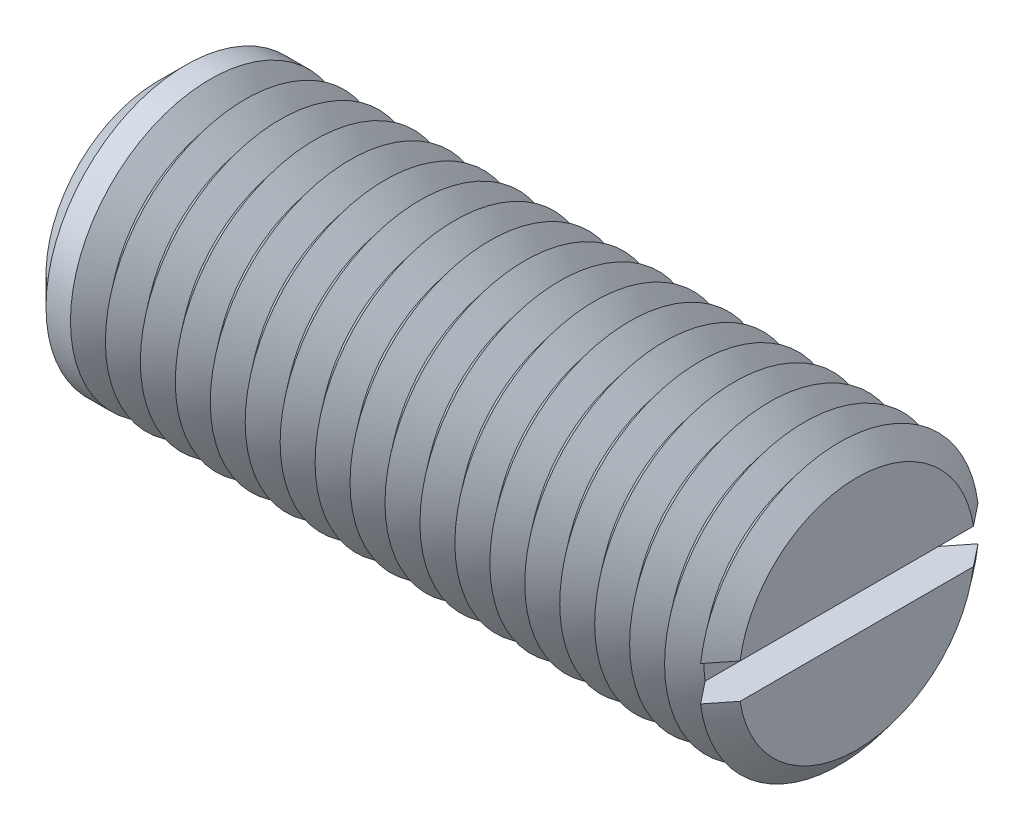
ISO-10303-21;
HEADER;
FILE_DESCRIPTION(('STEP AP214'),'2;1');
FILE_NAME('part.step','',(''),(''),'','','');
FILE_SCHEMA(('AUTOMOTIVE_DESIGN { 1 0 10303 214 1 1 1 1 }'));
ENDSEC;
DATA;
#1=APPLICATION_CONTEXT('core data for automotive mechanical design processes');
#2=APPLICATION_PROTOCOL_DEFINITION('international standard','automotive_design',2000,#1);
#3=PRODUCT_CONTEXT('',#1,'mechanical');
#4=PRODUCT('Part','Part','',(#3));
#5=PRODUCT_RELATED_PRODUCT_CATEGORY('part','',(#4));
#6=PRODUCT_DEFINITION_FORMATION('','',#4);
#7=PRODUCT_DEFINITION_CONTEXT('part definition',#1,'design');
#8=PRODUCT_DEFINITION('design','',#6,#7);
#9=PRODUCT_DEFINITION_SHAPE('','',#8);
#10=(LENGTH_UNIT() NAMED_UNIT(*) SI_UNIT(.MILLI.,.METRE.));
#11=(NAMED_UNIT(*) PLANE_ANGLE_UNIT() SI_UNIT($,.RADIAN.));
#12=(NAMED_UNIT(*) SI_UNIT($,.STERADIAN.) SOLID_ANGLE_UNIT());
#13=UNCERTAINTY_MEASURE_WITH_UNIT(LENGTH_MEASURE(1.E-05),#10,'distance_accuracy_value','');
#14=(GEOMETRIC_REPRESENTATION_CONTEXT(3) GLOBAL_UNCERTAINTY_ASSIGNED_CONTEXT((#13)) GLOBAL_UNIT_ASSIGNED_CONTEXT((#10,
#11,#12)) REPRESENTATION_CONTEXT('',''));
#15=CARTESIAN_POINT('',(0.,0.,0.));
#16=DIRECTION('',(0.,0.,1.));
#17=DIRECTION('',(1.,0.,0.));
#18=AXIS2_PLACEMENT_3D('',#15,#16,#17);
#19=CARTESIAN_POINT('',(19.,0.,0.));
#20=DIRECTION('',(1.,0.,0.));
#21=DIRECTION('',(0.,0.,-1.));
#22=AXIS2_PLACEMENT_3D('',#19,#20,#21);
#23=CONICAL_SURFACE('',#22,8.,0.895664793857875);
#24=CARTESIAN_POINT('',(19.,0.,0.));
#25=DIRECTION('',(-1.,0.,0.));
#26=DIRECTION('',(0.,0.,1.));
#27=AXIS2_PLACEMENT_3D('',#24,#25,#26);
#28=CIRCLE('',#27,8.);
#29=CARTESIAN_POINT('',(19.,-1.,-7.93725393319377));
#30=VERTEX_POINT('',#29);
#31=CARTESIAN_POINT('',(19.,-1.,7.93725393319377));
#32=VERTEX_POINT('',#31);
#33=EDGE_CURVE('E117',#30,#32,#28,.T.);
#34=ORIENTED_EDGE('',*,*,#33,.T.);
#35=CARTESIAN_POINT('',(26.6137872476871,-1.,-17.4810381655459));
#36=CARTESIAN_POINT('',(26.0731000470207,-1.,-16.8046018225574));
#37=CARTESIAN_POINT('',(25.5324624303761,-1.,-16.1281258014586));
#38=CARTESIAN_POINT('',(24.4513425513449,-1.,-14.7749910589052));
#39=CARTESIAN_POINT('',(23.9108602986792,-1.,-14.0983323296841));
#40=CARTESIAN_POINT('',(22.8295593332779,-1.,-12.7440423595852));
#41=CARTESIAN_POINT('',(22.2887409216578,-1.,-12.0664108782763));
#42=CARTESIAN_POINT('',(21.207566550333,-1.,-10.7108366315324));
#43=CARTESIAN_POINT('',(20.6672105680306,-1.,-10.0328938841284));
#44=CARTESIAN_POINT('',(19.8866021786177,-1.,-9.05235403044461));
#45=CARTESIAN_POINT('',(19.6460332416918,-1.,-8.75000893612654));
#46=CARTESIAN_POINT('',(19.1651110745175,-1.,-8.14514467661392));
#47=CARTESIAN_POINT('',(18.9247578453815,-1.,-7.84262551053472));
#48=CARTESIAN_POINT('',(18.4443170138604,-1.,-7.23730074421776));
#49=CARTESIAN_POINT('',(18.2042294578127,-1.,-6.93449510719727));
#50=CARTESIAN_POINT('',(17.7244992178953,-1.,-6.32854042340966));
#51=CARTESIAN_POINT('',(17.4848565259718,-1.,-6.02539138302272));
#52=CARTESIAN_POINT('',(17.0064209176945,-1.,-5.41876829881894));
#53=CARTESIAN_POINT('',(16.7676275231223,-1.,-5.11529463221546));
#54=CARTESIAN_POINT('',(16.291132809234,-1.,-4.50745556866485));
#55=CARTESIAN_POINT('',(16.0534315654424,-1.,-4.20309011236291));
#56=CARTESIAN_POINT('',(15.6984723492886,-1.,-3.74537358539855));
#57=CARTESIAN_POINT('',(15.580434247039,-1.,-3.59262786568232));
#58=CARTESIAN_POINT('',(15.3451171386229,-1.,-3.28655323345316));
#59=CARTESIAN_POINT('',(15.2278381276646,-1.,-3.13322432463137));
#60=CARTESIAN_POINT('',(14.9944317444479,-1.,-2.82571819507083));
#61=CARTESIAN_POINT('',(14.8783042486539,-1.,-2.67154106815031));
#62=CARTESIAN_POINT('',(14.6478553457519,-1.,-2.36184450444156));
#63=CARTESIAN_POINT('',(14.5335338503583,-1.,-2.20632513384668));
#64=CARTESIAN_POINT('',(14.3956998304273,-1.,-2.01476175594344));
#65=CARTESIAN_POINT('',(14.3706709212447,-1.,-1.97980928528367));
#66=CARTESIAN_POINT('',(14.3208007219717,-1.,-1.90977040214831));
#67=CARTESIAN_POINT('',(14.2959594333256,-1.,-1.87468398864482));
#68=CARTESIAN_POINT('',(14.2217527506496,-1.,-1.76919140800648));
#69=CARTESIAN_POINT('',(14.1727089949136,-1.,-1.69855807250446));
#70=CARTESIAN_POINT('',(14.0751159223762,-1.,-1.55549554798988));
#71=CARTESIAN_POINT('',(14.0265831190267,-1.,-1.48305505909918));
#72=CARTESIAN_POINT('',(13.9312399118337,-1.,-1.33706835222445));
#73=CARTESIAN_POINT('',(13.8844290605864,-1.,-1.26352242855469));
#74=CARTESIAN_POINT('',(13.7926759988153,-1.,-1.1137948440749));
#75=CARTESIAN_POINT('',(13.7477706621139,-1.,-1.03759043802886));
#76=CARTESIAN_POINT('',(13.661907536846,-1.,-0.88278002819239));
#77=CARTESIAN_POINT('',(13.6209558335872,-1.,-0.804170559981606));
#78=CARTESIAN_POINT('',(13.56478469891,-1.,-0.684500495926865));
#79=CARTESIAN_POINT('',(13.5470539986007,-1.,-0.644631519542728));
#80=CARTESIAN_POINT('',(13.5136729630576,-1.,-0.564036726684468));
#81=CARTESIAN_POINT('',(13.4980230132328,-1.,-0.523310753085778));
#82=CARTESIAN_POINT('',(13.4551526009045,-1.,-0.399956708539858));
#83=CARTESIAN_POINT('',(13.4318433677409,-1.,-0.315816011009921));
#84=CARTESIAN_POINT('',(13.4098657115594,-1.,-0.193542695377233));
#85=CARTESIAN_POINT('',(13.4047261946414,-1.,-0.156548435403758));
#86=CARTESIAN_POINT('',(13.3976757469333,-1.,-0.0822397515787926));
#87=CARTESIAN_POINT('',(13.3957650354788,-1.,-0.0449253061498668));
#88=CARTESIAN_POINT('',(13.3953106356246,-1.,0.0296935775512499));
#89=CARTESIAN_POINT('',(13.3967642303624,-1.,0.0669979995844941));
#90=CARTESIAN_POINT('',(13.402929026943,-1.,0.141334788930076));
#91=CARTESIAN_POINT('',(13.4076406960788,-1.,0.178367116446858));
#92=CARTESIAN_POINT('',(13.4224195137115,-1.,0.266117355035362));
#93=CARTESIAN_POINT('',(13.4338513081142,-1.,0.316604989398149));
#94=CARTESIAN_POINT('',(13.461310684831,-1.,0.416309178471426));
#95=CARTESIAN_POINT('',(13.4773414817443,-1.,0.465524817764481));
#96=CARTESIAN_POINT('',(13.5130409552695,-1.,0.56304966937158));
#97=CARTESIAN_POINT('',(13.5327381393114,-1.,0.611348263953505));
#98=CARTESIAN_POINT('',(13.5747706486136,-1.,0.706748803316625));
#99=CARTESIAN_POINT('',(13.5971051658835,-1.,0.753851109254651));
#100=CARTESIAN_POINT('',(13.6464135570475,-1.,0.852405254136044));
#101=CARTESIAN_POINT('',(13.6736257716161,-1.,0.903736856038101));
#102=CARTESIAN_POINT('',(13.7298407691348,-1.,1.00541472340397));
#103=CARTESIAN_POINT('',(13.7588439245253,-1.,1.05576078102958));
#104=CARTESIAN_POINT('',(13.8478642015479,-1.,1.20570300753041));
#105=CARTESIAN_POINT('',(13.909851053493,-1.,1.30412495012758));
#106=CARTESIAN_POINT('',(14.0370218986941,-1.,1.49921478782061));
#107=CARTESIAN_POINT('',(14.1022138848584,-1.,1.59587737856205));
#108=CARTESIAN_POINT('',(14.234509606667,-1.,1.78781770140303));
#109=CARTESIAN_POINT('',(14.3016124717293,-1.,1.88309603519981));
#110=CARTESIAN_POINT('',(14.4371969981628,-1.,2.07285006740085));
#111=CARTESIAN_POINT('',(14.5056803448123,-1.,2.16732455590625));
#112=CARTESIAN_POINT('',(14.6435598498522,-1.,2.35561985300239));
#113=CARTESIAN_POINT('',(14.7129561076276,-1.,2.4494405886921));
#114=CARTESIAN_POINT('',(14.8522867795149,-1.,2.63643541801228));
#115=CARTESIAN_POINT('',(14.9222200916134,-1.,2.72961033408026));
#116=CARTESIAN_POINT('',(15.0625737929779,-1.,2.91558674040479));
#117=CARTESIAN_POINT('',(15.1329941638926,-1.,3.00838824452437));
#118=CARTESIAN_POINT('',(15.3434401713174,-1.,3.28457080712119));
#119=CARTESIAN_POINT('',(15.4840068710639,-1.,3.46753938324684));
#120=CARTESIAN_POINT('',(15.766047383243,-1.,3.83277652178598));
#121=CARTESIAN_POINT('',(15.9075212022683,-1.,4.0150450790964));
#122=CARTESIAN_POINT('',(16.332844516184,-1.,4.56116633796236));
#123=CARTESIAN_POINT('',(16.6175870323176,-1.,4.92432312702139));
#124=CARTESIAN_POINT('',(17.188450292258,-1.,5.64994266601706));
#125=CARTESIAN_POINT('',(17.474571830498,-1.,6.01240478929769));
#126=CARTESIAN_POINT('',(18.0475166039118,-1.,6.73676512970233));
#127=CARTESIAN_POINT('',(18.334339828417,-1.,7.09866335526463));
#128=CARTESIAN_POINT('',(18.9076446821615,-1.,7.82112227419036));
#129=CARTESIAN_POINT('',(19.194125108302,-1.,8.18168392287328));
#130=CARTESIAN_POINT('',(19.7673842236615,-1.,8.90257236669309));
#131=CARTESIAN_POINT('',(20.0541629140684,-1.,9.2628991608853));
#132=CARTESIAN_POINT('',(20.9146958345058,-1.,10.3434977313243));
#133=CARTESIAN_POINT('',(21.4887564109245,-1.,11.0635255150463));
#134=CARTESIAN_POINT('',(22.4416309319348,-1.,12.2579358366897));
#135=CARTESIAN_POINT('',(22.8203198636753,-1.,12.7324181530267));
#136=CARTESIAN_POINT('',(23.577860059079,-1.,13.6812951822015));
#137=CARTESIAN_POINT('',(23.9567113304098,-1.,14.1556898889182));
#138=CARTESIAN_POINT('',(24.7152320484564,-1.,15.1052923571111));
#139=CARTESIAN_POINT('',(25.0949016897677,-1.,15.5804999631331));
#140=CARTESIAN_POINT('',(25.8543004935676,-1.,16.5308253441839));
#141=CARTESIAN_POINT('',(26.2340296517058,-1.,17.005943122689));
#142=CARTESIAN_POINT('',(26.6137872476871,-1.,17.4810381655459));
#143=B_SPLINE_CURVE_WITH_KNOTS('',3,(#35,#36,#37,#38,#39,#40,#41,#42,#43,#44,#45,#46,#47,#48,
#49,#50,#51,#52,#53,#54,#55,#56,#57,#58,#59,#60,#61,#62,#63,#64,#65,#66,#67,#68,#69,#70,#71,#72,
#73,#74,#75,#76,#77,#78,#79,#80,#81,#82,#83,#84,#85,#86,#87,#88,#89,#90,#91,#92,#93,#94,#95,#96,
#97,#98,#99,#100,#101,#102,#103,#104,#105,#106,#107,#108,#109,#110,#111,#112,#113,#114,#115,
#116,#117,#118,#119,#120,#121,#122,#123,#124,#125,#126,#127,#128,#129,#130,#131,#132,#133,#134,
#135,#136,#137,#138,#139,#140,#141,#142),.UNSPECIFIED.,.F.,.F.,(4,2,2,2,2,2,2,2,2,2,2,2,2,2,2,2,
2,2,2,2,2,2,2,2,2,2,2,2,2,2,2,2,2,2,2,2,2,2,2,2,2,2,2,2,2,2,2,2,2,2,2,2,2,4),(0.,
2.59791825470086,5.19597381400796,7.79693910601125,10.3977690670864,11.5568952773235,
12.7160274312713,13.8753371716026,15.0346257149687,16.1931009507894,17.3516551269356,
17.9307722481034,18.5098857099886,19.0889363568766,19.6679586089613,19.7969273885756,
19.9258971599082,20.1838595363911,20.4454304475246,20.7069329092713,20.9722220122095,
21.2379131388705,21.3687577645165,21.4996265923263,21.7602408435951,21.8721711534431,
21.9841090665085,22.0959566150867,22.2078202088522,22.3628274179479,22.5179432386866,
22.6743197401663,22.8306484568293,23.0048946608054,23.1791772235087,23.5280071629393,
23.8777561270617,24.2273482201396,24.5773965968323,24.927483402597,25.2769811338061,
25.6264657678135,26.3186514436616,27.0108421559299,28.3952670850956,29.7806179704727,
31.1659479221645,32.5474981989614,33.9290539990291,36.6916375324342,38.5128593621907,
40.334179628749,42.1589376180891,43.9835965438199),.UNSPECIFIED.);
#144=CARTESIAN_POINT('',(18.,-1.,6.67652652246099));
#145=VERTEX_POINT('',#144);
#146=EDGE_CURVE('E109',#145,#32,#143,.T.);
#147=ORIENTED_EDGE('',*,*,#146,.F.);
#148=CARTESIAN_POINT('',(18.,0.,0.));
#149=DIRECTION('',(-1.,0.,0.));
#150=DIRECTION('',(0.,0.,1.));
#151=AXIS2_PLACEMENT_3D('',#148,#149,#150);
#152=CIRCLE('',#151,6.75100040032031);
#153=CARTESIAN_POINT('',(18.,-1.,-6.67652652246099));
#154=VERTEX_POINT('',#153);
#155=EDGE_CURVE('E368',#154,#145,#152,.T.);
#156=ORIENTED_EDGE('',*,*,#155,.F.);
#157=EDGE_CURVE('E58',#30,#154,#143,.T.);
#158=ORIENTED_EDGE('',*,*,#157,.F.);
#159=EDGE_LOOP('',(#34,#147,#156,#158));
#160=FACE_BOUND('',#159,.T.);
#161=ADVANCED_FACE('F37',(#160),#23,.T.);
#162=CARTESIAN_POINT('',(19.,1.,7.93725393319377));
#163=VERTEX_POINT('',#162);
#164=CARTESIAN_POINT('',(19.,1.,-7.93725393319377));
#165=VERTEX_POINT('',#164);
#166=EDGE_CURVE('E100',#163,#165,#28,.T.);
#167=ORIENTED_EDGE('',*,*,#166,.T.);
#168=CARTESIAN_POINT('',(26.6137872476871,1.,17.4810381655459));
#169=CARTESIAN_POINT('',(26.0731000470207,1.,16.8046018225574));
#170=CARTESIAN_POINT('',(25.5324624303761,1.,16.1281258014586));
#171=CARTESIAN_POINT('',(24.4513425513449,1.,14.7749910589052));
#172=CARTESIAN_POINT('',(23.9108602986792,1.,14.0983323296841));
#173=CARTESIAN_POINT('',(22.8295593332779,1.,12.7440423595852));
#174=CARTESIAN_POINT('',(22.2887409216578,1.,12.0664108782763));
#175=CARTESIAN_POINT('',(21.207566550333,1.,10.7108366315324));
#176=CARTESIAN_POINT('',(20.6672105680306,1.,10.0328938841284));
#177=CARTESIAN_POINT('',(19.8866021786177,1.,9.05235403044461));
#178=CARTESIAN_POINT('',(19.6460332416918,1.,8.75000893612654));
#179=CARTESIAN_POINT('',(19.1651110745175,1.,8.14514467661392));
#180=CARTESIAN_POINT('',(18.9247578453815,1.,7.84262551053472));
#181=CARTESIAN_POINT('',(18.4443170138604,1.,7.23730074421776));
#182=CARTESIAN_POINT('',(18.2042294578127,1.,6.93449510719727));
#183=CARTESIAN_POINT('',(17.7244992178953,1.,6.32854042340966));
#184=CARTESIAN_POINT('',(17.4848565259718,1.,6.02539138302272));
#185=CARTESIAN_POINT('',(17.0064209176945,1.,5.41876829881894));
#186=CARTESIAN_POINT('',(16.7676275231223,1.,5.11529463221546));
#187=CARTESIAN_POINT('',(16.291132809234,1.,4.50745556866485));
#188=CARTESIAN_POINT('',(16.0534315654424,1.,4.20309011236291));
#189=CARTESIAN_POINT('',(15.6984723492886,1.,3.74537358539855));
#190=CARTESIAN_POINT('',(15.580434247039,1.,3.59262786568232));
#191=CARTESIAN_POINT('',(15.3451171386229,1.,3.28655323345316));
#192=CARTESIAN_POINT('',(15.2278381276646,1.,3.13322432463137));
#193=CARTESIAN_POINT('',(14.9944317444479,1.,2.82571819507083));
#194=CARTESIAN_POINT('',(14.8783042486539,1.,2.67154106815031));
#195=CARTESIAN_POINT('',(14.6478553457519,1.,2.36184450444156));
#196=CARTESIAN_POINT('',(14.5335338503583,1.,2.20632513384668));
#197=CARTESIAN_POINT('',(14.3956998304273,1.,2.01476175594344));
#198=CARTESIAN_POINT('',(14.3706709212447,1.,1.97980928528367));
#199=CARTESIAN_POINT('',(14.3208007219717,1.,1.90977040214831));
#200=CARTESIAN_POINT('',(14.2959594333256,1.,1.87468398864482));
#201=CARTESIAN_POINT('',(14.2217527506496,1.,1.76919140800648));
#202=CARTESIAN_POINT('',(14.1727089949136,1.,1.69855807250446));
#203=CARTESIAN_POINT('',(14.0751159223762,1.,1.55549554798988));
#204=CARTESIAN_POINT('',(14.0265831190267,1.,1.48305505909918));
#205=CARTESIAN_POINT('',(13.9312399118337,1.,1.33706835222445));
#206=CARTESIAN_POINT('',(13.8844290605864,1.,1.26352242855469));
#207=CARTESIAN_POINT('',(13.7926759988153,1.,1.1137948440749));
#208=CARTESIAN_POINT('',(13.7477706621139,1.,1.03759043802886));
#209=CARTESIAN_POINT('',(13.661907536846,1.,0.88278002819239));
#210=CARTESIAN_POINT('',(13.6209558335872,1.,0.804170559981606));
#211=CARTESIAN_POINT('',(13.56478469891,1.,0.684500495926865));
#212=CARTESIAN_POINT('',(13.5470539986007,1.,0.644631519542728));
#213=CARTESIAN_POINT('',(13.5136729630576,1.,0.564036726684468));
#214=CARTESIAN_POINT('',(13.4980230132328,1.,0.523310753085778));
#215=CARTESIAN_POINT('',(13.4551526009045,1.,0.399956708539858));
#216=CARTESIAN_POINT('',(13.4318433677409,1.,0.315816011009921));
#217=CARTESIAN_POINT('',(13.4098657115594,1.,0.193542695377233));
#218=CARTESIAN_POINT('',(13.4047261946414,1.,0.156548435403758));
#219=CARTESIAN_POINT('',(13.3976757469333,1.,0.0822397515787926));
#220=CARTESIAN_POINT('',(13.3957650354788,1.,0.0449253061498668));
#221=CARTESIAN_POINT('',(13.3953106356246,1.,-0.0296935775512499));
#222=CARTESIAN_POINT('',(13.3967642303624,1.,-0.0669979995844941));
#223=CARTESIAN_POINT('',(13.402929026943,1.,-0.141334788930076));
#224=CARTESIAN_POINT('',(13.4076406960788,1.,-0.178367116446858));
#225=CARTESIAN_POINT('',(13.4224195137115,1.,-0.266117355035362));
#226=CARTESIAN_POINT('',(13.4338513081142,1.,-0.316604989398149));
#227=CARTESIAN_POINT('',(13.461310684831,1.,-0.416309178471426));
#228=CARTESIAN_POINT('',(13.4773414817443,1.,-0.465524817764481));
#229=CARTESIAN_POINT('',(13.5130409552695,1.,-0.56304966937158));
#230=CARTESIAN_POINT('',(13.5327381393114,1.,-0.611348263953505));
#231=CARTESIAN_POINT('',(13.5747706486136,1.,-0.706748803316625));
#232=CARTESIAN_POINT('',(13.5971051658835,1.,-0.753851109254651));
#233=CARTESIAN_POINT('',(13.6464135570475,1.,-0.852405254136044));
#234=CARTESIAN_POINT('',(13.6736257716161,1.,-0.903736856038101));
#235=CARTESIAN_POINT('',(13.7298407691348,1.,-1.00541472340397));
#236=CARTESIAN_POINT('',(13.7588439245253,1.,-1.05576078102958));
#237=CARTESIAN_POINT('',(13.8478642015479,1.,-1.20570300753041));
#238=CARTESIAN_POINT('',(13.909851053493,1.,-1.30412495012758));
#239=CARTESIAN_POINT('',(14.0370218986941,1.,-1.49921478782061));
#240=CARTESIAN_POINT('',(14.1022138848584,1.,-1.59587737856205));
#241=CARTESIAN_POINT('',(14.234509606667,1.,-1.78781770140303));
#242=CARTESIAN_POINT('',(14.3016124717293,1.,-1.88309603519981));
#243=CARTESIAN_POINT('',(14.4371969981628,1.,-2.07285006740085));
#244=CARTESIAN_POINT('',(14.5056803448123,1.,-2.16732455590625));
#245=CARTESIAN_POINT('',(14.6435598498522,1.,-2.35561985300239));
#246=CARTESIAN_POINT('',(14.7129561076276,1.,-2.4494405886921));
#247=CARTESIAN_POINT('',(14.8522867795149,1.,-2.63643541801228));
#248=CARTESIAN_POINT('',(14.9222200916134,1.,-2.72961033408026));
#249=CARTESIAN_POINT('',(15.0625737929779,1.,-2.91558674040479));
#250=CARTESIAN_POINT('',(15.1329941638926,1.,-3.00838824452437));
#251=CARTESIAN_POINT('',(15.3434401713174,1.,-3.28457080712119));
#252=CARTESIAN_POINT('',(15.4840068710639,1.,-3.46753938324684));
#253=CARTESIAN_POINT('',(15.766047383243,1.,-3.83277652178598));
#254=CARTESIAN_POINT('',(15.9075212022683,1.,-4.0150450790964));
#255=CARTESIAN_POINT('',(16.332844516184,1.,-4.56116633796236));
#256=CARTESIAN_POINT('',(16.6175870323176,1.,-4.92432312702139));
#257=CARTESIAN_POINT('',(17.188450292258,1.,-5.64994266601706));
#258=CARTESIAN_POINT('',(17.474571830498,1.,-6.01240478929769));
#259=CARTESIAN_POINT('',(18.0475166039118,1.,-6.73676512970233));
#260=CARTESIAN_POINT('',(18.334339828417,1.,-7.09866335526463));
#261=CARTESIAN_POINT('',(18.9076446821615,1.,-7.82112227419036));
#262=CARTESIAN_POINT('',(19.194125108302,1.,-8.18168392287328));
#263=CARTESIAN_POINT('',(19.7673842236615,1.,-8.90257236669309));
#264=CARTESIAN_POINT('',(20.0541629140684,1.,-9.2628991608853));
#265=CARTESIAN_POINT('',(20.9146958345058,1.,-10.3434977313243));
#266=CARTESIAN_POINT('',(21.4887564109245,1.,-11.0635255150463));
#267=CARTESIAN_POINT('',(22.4416309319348,1.,-12.2579358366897));
#268=CARTESIAN_POINT('',(22.8203198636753,1.,-12.7324181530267));
#269=CARTESIAN_POINT('',(23.577860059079,1.,-13.6812951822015));
#270=CARTESIAN_POINT('',(23.9567113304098,1.,-14.1556898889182));
#271=CARTESIAN_POINT('',(24.7152320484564,1.,-15.1052923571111));
#272=CARTESIAN_POINT('',(25.0949016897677,1.,-15.5804999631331));
#273=CARTESIAN_POINT('',(25.8543004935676,1.,-16.5308253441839));
#274=CARTESIAN_POINT('',(26.2340296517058,1.,-17.005943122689));
#275=CARTESIAN_POINT('',(26.6137872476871,1.,-17.4810381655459));
#276=B_SPLINE_CURVE_WITH_KNOTS('',3,(#168,#169,#170,#171,#172,#173,#174,#175,#176,#177,#178,
#179,#180,#181,#182,#183,#184,#185,#186,#187,#188,#189,#190,#191,#192,#193,#194,#195,#196,#197,
#198,#199,#200,#201,#202,#203,#204,#205,#206,#207,#208,#209,#210,#211,#212,#213,#214,#215,#216,
#217,#218,#219,#220,#221,#222,#223,#224,#225,#226,#227,#228,#229,#230,#231,#232,#233,#234,#235,
#236,#237,#238,#239,#240,#241,#242,#243,#244,#245,#246,#247,#248,#249,#250,#251,#252,#253,#254,
#255,#256,#257,#258,#259,#260,#261,#262,#263,#264,#265,#266,#267,#268,#269,#270,#271,#272,#273,
#274,#275),.UNSPECIFIED.,.F.,.F.,(4,2,2,2,2,2,2,2,2,2,2,2,2,2,2,2,2,2,2,2,2,2,2,2,2,2,2,2,2,2,2,
2,2,2,2,2,2,2,2,2,2,2,2,2,2,2,2,2,2,2,2,2,2,4),(0.,2.59791825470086,5.19597381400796,
7.79693910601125,10.3977690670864,11.5568952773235,12.7160274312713,13.8753371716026,
15.0346257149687,16.1931009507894,17.3516551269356,17.9307722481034,18.5098857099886,
19.0889363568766,19.6679586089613,19.7969273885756,19.9258971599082,20.1838595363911,
20.4454304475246,20.7069329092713,20.9722220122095,21.2379131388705,21.3687577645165,
21.4996265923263,21.7602408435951,21.8721711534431,21.9841090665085,22.0959566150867,
22.2078202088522,22.3628274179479,22.5179432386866,22.6743197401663,22.8306484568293,
23.0048946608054,23.1791772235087,23.5280071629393,23.8777561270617,24.2273482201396,
24.5773965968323,24.927483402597,25.2769811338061,25.6264657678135,26.3186514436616,
27.0108421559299,28.3952670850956,29.7806179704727,31.1659479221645,32.5474981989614,
33.9290539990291,36.6916375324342,38.5128593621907,40.334179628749,42.1589376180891,
43.9835965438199),.UNSPECIFIED.);
#277=CARTESIAN_POINT('',(18.,1.,-6.67652652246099));
#278=VERTEX_POINT('',#277);
#279=EDGE_CURVE('E110',#278,#165,#276,.T.);
#280=ORIENTED_EDGE('',*,*,#279,.F.);
#281=CARTESIAN_POINT('',(18.,1.,6.67652652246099));
#282=VERTEX_POINT('',#281);
#283=EDGE_CURVE('E103',#282,#278,#152,.T.);
#284=ORIENTED_EDGE('',*,*,#283,.F.);
#285=EDGE_CURVE('E97',#163,#282,#276,.T.);
#286=ORIENTED_EDGE('',*,*,#285,.F.);
#287=EDGE_LOOP('',(#167,#280,#284,#286));
#288=FACE_BOUND('',#287,.T.);
#289=ADVANCED_FACE('F99',(#288),#23,.T.);
#290=CARTESIAN_POINT('',(18.,0.,0.));
#291=DIRECTION('',(-1.,0.,0.));
#292=DIRECTION('',(0.,0.,1.));
#293=AXIS2_PLACEMENT_3D('',#290,#291,#292);
#294=CONICAL_SURFACE('',#293,6.75100040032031,0.895664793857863);
#295=CARTESIAN_POINT('',(17.,0.,0.));
#296=DIRECTION('',(-1.,0.,0.));
#297=DIRECTION('',(0.,0.,1.));
#298=AXIS2_PLACEMENT_3D('',#295,#296,#297);
#299=CIRCLE('',#298,8.);
#300=CARTESIAN_POINT('',(17.,0.,8.));
#301=VERTEX_POINT('',#300);
#302=EDGE_CURVE('E355',#301,#301,#299,.T.);
#303=ORIENTED_EDGE('',*,*,#302,.F.);
#304=EDGE_LOOP('',(#303));
#305=FACE_BOUND('',#304,.T.);
#306=ORIENTED_EDGE('',*,*,#283,.T.);
#307=EDGE_CURVE('E363',#278,#154,#152,.T.);
#308=ORIENTED_EDGE('',*,*,#307,.T.);
#309=ORIENTED_EDGE('',*,*,#155,.T.);
#310=EDGE_CURVE('E362',#145,#282,#152,.T.);
#311=ORIENTED_EDGE('',*,*,#310,.T.);
#312=EDGE_LOOP('',(#306,#308,#309,#311));
#313=FACE_BOUND('',#312,.T.);
#314=ADVANCED_FACE('F168',(#305,#313),#294,.T.);
#315=CARTESIAN_POINT('',(20.,0.,0.));
#316=DIRECTION('',(1.,0.,0.));
#317=DIRECTION('',(0.,0.,-1.));
#318=AXIS2_PLACEMENT_3D('',#315,#316,#317);
#319=PLANE('',#318);
#320=CARTESIAN_POINT('',(20.,0.,0.));
#321=DIRECTION('',(-1.,0.,0.));
#322=DIRECTION('',(0.,0.,1.));
#323=AXIS2_PLACEMENT_3D('',#320,#321,#322);
#324=CIRCLE('',#323,6.75100040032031);
#325=CARTESIAN_POINT('',(20.,1.,6.67652652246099));
#326=VERTEX_POINT('',#325);
#327=CARTESIAN_POINT('',(20.,1.,-6.67652652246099));
#328=VERTEX_POINT('',#327);
#329=EDGE_CURVE('E160',#326,#328,#324,.T.);
#330=ORIENTED_EDGE('',*,*,#329,.F.);
#331=DIRECTION('',(0.,0.,1.));
#332=VECTOR('',#331,1.);
#333=CARTESIAN_POINT('',(20.,1.,0.));
#334=LINE('',#333,#332);
#335=EDGE_CURVE('E122',#328,#326,#334,.T.);
#336=ORIENTED_EDGE('',*,*,#335,.F.);
#337=EDGE_LOOP('',(#330,#336));
#338=FACE_BOUND('',#337,.T.);
#339=ADVANCED_FACE('F172',(#338),#319,.T.);
#340=CARTESIAN_POINT('',(20.,-1.,-6.67652652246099));
#341=VERTEX_POINT('',#340);
#342=CARTESIAN_POINT('',(20.,-1.,6.67652652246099));
#343=VERTEX_POINT('',#342);
#344=EDGE_CURVE('E66',#341,#343,#324,.T.);
#345=ORIENTED_EDGE('',*,*,#344,.F.);
#346=DIRECTION('',(0.,0.,-1.));
#347=VECTOR('',#346,1.);
#348=CARTESIAN_POINT('',(20.,-1.,0.));
#349=LINE('',#348,#347);
#350=EDGE_CURVE('E136',#343,#341,#349,.T.);
#351=ORIENTED_EDGE('',*,*,#350,.F.);
#352=EDGE_LOOP('',(#345,#351));
#353=FACE_BOUND('',#352,.T.);
#354=ADVANCED_FACE('F201',(#353),#319,.T.);
#355=CARTESIAN_POINT('',(20.,0.,0.));
#356=DIRECTION('',(-1.,0.,0.));
#357=DIRECTION('',(0.,0.,1.));
#358=AXIS2_PLACEMENT_3D('',#355,#356,#357);
#359=CONICAL_SURFACE('',#358,6.75100040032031,0.895664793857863);
#360=ORIENTED_EDGE('',*,*,#166,.F.);
#361=CARTESIAN_POINT('',(11.3862127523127,1.,-17.4810381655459));
#362=CARTESIAN_POINT('',(11.9268999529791,1.,-16.8046018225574));
#363=CARTESIAN_POINT('',(12.4675375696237,1.,-16.1281258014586));
#364=CARTESIAN_POINT('',(13.5486574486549,1.,-14.7749910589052));
#365=CARTESIAN_POINT('',(14.0891397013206,1.,-14.0983323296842));
#366=CARTESIAN_POINT('',(15.1704406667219,1.,-12.7440423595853));
#367=CARTESIAN_POINT('',(15.711259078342,1.,-12.0664108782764));
#368=CARTESIAN_POINT('',(16.7924334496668,1.,-10.7108366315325));
#369=CARTESIAN_POINT('',(17.3327894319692,1.,-10.0328938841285));
#370=CARTESIAN_POINT('',(18.1133978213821,1.,-9.05235403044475));
#371=CARTESIAN_POINT('',(18.3539667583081,1.,-8.75000893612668));
#372=CARTESIAN_POINT('',(18.8348889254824,1.,-8.14514467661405));
#373=CARTESIAN_POINT('',(19.0752421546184,1.,-7.84262551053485));
#374=CARTESIAN_POINT('',(19.5556829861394,1.,-7.23730074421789));
#375=CARTESIAN_POINT('',(19.7957705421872,1.,-6.9344951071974));
#376=CARTESIAN_POINT('',(20.2755007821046,1.,-6.32854042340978));
#377=CARTESIAN_POINT('',(20.5151434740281,1.,-6.02539138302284));
#378=CARTESIAN_POINT('',(20.9935790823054,1.,-5.41876829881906));
#379=CARTESIAN_POINT('',(21.2323724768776,1.,-5.11529463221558));
#380=CARTESIAN_POINT('',(21.708867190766,1.,-4.50745556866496));
#381=CARTESIAN_POINT('',(21.9465684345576,1.,-4.20309011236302));
#382=CARTESIAN_POINT('',(22.3015276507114,1.,-3.74537358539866));
#383=CARTESIAN_POINT('',(22.419565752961,1.,-3.59262786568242));
#384=CARTESIAN_POINT('',(22.6548828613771,1.,-3.28655323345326));
#385=CARTESIAN_POINT('',(22.7721618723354,1.,-3.13322432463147));
#386=CARTESIAN_POINT('',(23.0055682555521,1.,-2.82571819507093));
#387=CARTESIAN_POINT('',(23.1216957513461,1.,-2.67154106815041));
#388=CARTESIAN_POINT('',(23.3521446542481,1.,-2.36184450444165));
#389=CARTESIAN_POINT('',(23.4664661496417,1.,-2.20632513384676));
#390=CARTESIAN_POINT('',(23.6043001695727,1.,-2.01476175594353));
#391=CARTESIAN_POINT('',(23.6293290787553,1.,-1.97980928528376));
#392=CARTESIAN_POINT('',(23.6791992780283,1.,-1.9097704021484));
#393=CARTESIAN_POINT('',(23.7040405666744,1.,-1.87468398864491));
#394=CARTESIAN_POINT('',(23.7782472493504,1.,-1.76919140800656));
#395=CARTESIAN_POINT('',(23.8272910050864,1.,-1.69855807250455));
#396=CARTESIAN_POINT('',(23.9248840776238,1.,-1.55549554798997));
#397=CARTESIAN_POINT('',(23.9734168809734,1.,-1.48305505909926));
#398=CARTESIAN_POINT('',(24.0687600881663,1.,-1.33706835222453));
#399=CARTESIAN_POINT('',(24.1155709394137,1.,-1.26352242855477));
#400=CARTESIAN_POINT('',(24.2073240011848,1.,-1.11379484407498));
#401=CARTESIAN_POINT('',(24.2522293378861,1.,-1.03759043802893));
#402=CARTESIAN_POINT('',(24.3380924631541,1.,-0.882780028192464));
#403=CARTESIAN_POINT('',(24.3790441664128,1.,-0.80417055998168));
#404=CARTESIAN_POINT('',(24.4352153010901,1.,-0.684500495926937));
#405=CARTESIAN_POINT('',(24.4529460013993,1.,-0.644631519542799));
#406=CARTESIAN_POINT('',(24.4863270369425,1.,-0.564036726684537));
#407=CARTESIAN_POINT('',(24.5019769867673,1.,-0.523310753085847));
#408=CARTESIAN_POINT('',(24.5448473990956,1.,-0.399956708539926));
#409=CARTESIAN_POINT('',(24.5681566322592,1.,-0.315816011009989));
#410=CARTESIAN_POINT('',(24.5901342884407,1.,-0.193542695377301));
#411=CARTESIAN_POINT('',(24.5952738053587,1.,-0.156548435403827));
#412=CARTESIAN_POINT('',(24.6023242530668,1.,-0.0822397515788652));
#413=CARTESIAN_POINT('',(24.6042349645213,1.,-0.0449253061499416));
#414=CARTESIAN_POINT('',(24.6046893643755,1.,0.0296935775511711));
#415=CARTESIAN_POINT('',(24.6032357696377,1.,0.0669979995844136));
#416=CARTESIAN_POINT('',(24.5970709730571,1.,0.141334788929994));
#417=CARTESIAN_POINT('',(24.5923593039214,1.,0.178367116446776));
#418=CARTESIAN_POINT('',(24.5775804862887,1.,0.266117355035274));
#419=CARTESIAN_POINT('',(24.5661486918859,1.,0.316604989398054));
#420=CARTESIAN_POINT('',(24.5386893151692,1.,0.416309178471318));
#421=CARTESIAN_POINT('',(24.5226585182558,1.,0.465524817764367));
#422=CARTESIAN_POINT('',(24.4869590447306,1.,0.563049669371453));
#423=CARTESIAN_POINT('',(24.4672618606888,1.,0.611348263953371));
#424=CARTESIAN_POINT('',(24.4252293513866,1.,0.706748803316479));
#425=CARTESIAN_POINT('',(24.4028948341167,1.,0.753851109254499));
#426=CARTESIAN_POINT('',(24.3535864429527,1.,0.852405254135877));
#427=CARTESIAN_POINT('',(24.3263742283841,1.,0.903736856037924));
#428=CARTESIAN_POINT('',(24.2701592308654,1.,1.00541472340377));
#429=CARTESIAN_POINT('',(24.2411560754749,1.,1.05576078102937));
#430=CARTESIAN_POINT('',(24.1521357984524,1.,1.20570300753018));
#431=CARTESIAN_POINT('',(24.0901489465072,1.,1.30412495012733));
#432=CARTESIAN_POINT('',(23.9629781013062,1.,1.49921478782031));
#433=CARTESIAN_POINT('',(23.8977861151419,1.,1.59587737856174));
#434=CARTESIAN_POINT('',(23.7654903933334,1.,1.78781770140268));
#435=CARTESIAN_POINT('',(23.698387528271,1.,1.88309603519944));
#436=CARTESIAN_POINT('',(23.5628030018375,1.,2.07285006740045));
#437=CARTESIAN_POINT('',(23.4943196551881,1.,2.16732455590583));
#438=CARTESIAN_POINT('',(23.3564401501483,1.,2.35561985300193));
#439=CARTESIAN_POINT('',(23.2870438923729,1.,2.44944058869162));
#440=CARTESIAN_POINT('',(23.1477132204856,1.,2.63643541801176));
#441=CARTESIAN_POINT('',(23.077779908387,1.,2.72961033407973));
#442=CARTESIAN_POINT('',(22.9374262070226,1.,2.91558674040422));
#443=CARTESIAN_POINT('',(22.8670058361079,1.,3.00838824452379));
#444=CARTESIAN_POINT('',(22.6565598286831,1.,3.28457080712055));
#445=CARTESIAN_POINT('',(22.5159931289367,1.,3.46753938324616));
#446=CARTESIAN_POINT('',(22.2339526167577,1.,3.83277652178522));
#447=CARTESIAN_POINT('',(22.0924787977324,1.,4.01504507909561));
#448=CARTESIAN_POINT('',(21.6671554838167,1.,4.56116633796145));
#449=CARTESIAN_POINT('',(21.3824129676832,1.,4.9243231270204));
#450=CARTESIAN_POINT('',(20.811549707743,1.,5.64994266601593));
#451=CARTESIAN_POINT('',(20.5254281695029,1.,6.01240478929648));
#452=CARTESIAN_POINT('',(19.9524833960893,1.,6.73676512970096));
#453=CARTESIAN_POINT('',(19.6656601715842,1.,7.09866335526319));
#454=CARTESIAN_POINT('',(19.0923553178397,1.,7.82112227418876));
#455=CARTESIAN_POINT('',(18.8058748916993,1.,8.1816839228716));
#456=CARTESIAN_POINT('',(18.2326157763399,1.,8.90257236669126));
#457=CARTESIAN_POINT('',(17.9458370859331,1.,9.26289916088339));
#458=CARTESIAN_POINT('',(17.0853041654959,1.,10.3434977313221));
#459=CARTESIAN_POINT('',(16.5112435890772,1.,11.063525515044));
#460=CARTESIAN_POINT('',(15.5583690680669,1.,12.2579358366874));
#461=CARTESIAN_POINT('',(15.1796801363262,1.,12.7324181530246));
#462=CARTESIAN_POINT('',(14.4221399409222,1.,13.6812951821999));
#463=CARTESIAN_POINT('',(14.0432886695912,1.,14.1556898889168));
#464=CARTESIAN_POINT('',(13.2847679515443,1.,15.10529235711));
#465=CARTESIAN_POINT('',(12.9050983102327,1.,15.5804999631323));
#466=CARTESIAN_POINT('',(12.1456995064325,1.,16.5308253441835));
#467=CARTESIAN_POINT('',(11.7659703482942,1.,17.0059431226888));
#468=CARTESIAN_POINT('',(11.3862127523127,1.,17.4810381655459));
#469=B_SPLINE_CURVE_WITH_KNOTS('',3,(#361,#362,#363,#364,#365,#366,#367,#368,#369,#370,#371,
#372,#373,#374,#375,#376,#377,#378,#379,#380,#381,#382,#383,#384,#385,#386,#387,#388,#389,#390,
#391,#392,#393,#394,#395,#396,#397,#398,#399,#400,#401,#402,#403,#404,#405,#406,#407,#408,#409,
#410,#411,#412,#413,#414,#415,#416,#417,#418,#419,#420,#421,#422,#423,#424,#425,#426,#427,#428,
#429,#430,#431,#432,#433,#434,#435,#436,#437,#438,#439,#440,#441,#442,#443,#444,#445,#446,#447,
#448,#449,#450,#451,#452,#453,#454,#455,#456,#457,#458,#459,#460,#461,#462,#463,#464,#465,#466,
#467,#468),.UNSPECIFIED.,.F.,.F.,(4,2,2,2,2,2,2,2,2,2,2,2,2,2,2,2,2,2,2,2,2,2,2,2,2,2,2,2,2,2,2,
2,2,2,2,2,2,2,2,2,2,2,2,2,2,2,2,2,2,2,2,2,2,4),(0.,2.59791825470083,5.19597381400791,
7.79693910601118,10.3977690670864,11.5568952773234,12.7160274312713,13.8753371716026,
15.0346257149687,16.1931009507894,17.3516551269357,17.9307722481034,18.5098857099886,
19.0889363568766,19.6679586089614,19.7969273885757,19.9258971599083,20.1838595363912,
20.4454304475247,20.7069329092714,20.9722220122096,21.2379131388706,21.3687577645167,
21.4996265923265,21.7602408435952,21.8721711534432,21.9841090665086,22.0959566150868,
22.2078202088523,22.362827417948,22.5179432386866,22.6743197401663,22.8306484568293,
23.0048946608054,23.1791772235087,23.5280071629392,23.8777561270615,24.2273482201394,
24.577396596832,24.9274834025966,25.2769811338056,25.626465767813,26.3186514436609,
27.0108421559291,28.3952670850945,29.7806179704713,31.1659479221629,32.5474981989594,
33.9290539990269,36.6916375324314,38.5128593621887,40.3341796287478,42.1589376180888,
43.9835965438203),.UNSPECIFIED.);
#470=EDGE_CURVE('E41',#326,#163,#469,.T.);
#471=ORIENTED_EDGE('',*,*,#470,.F.);
#472=ORIENTED_EDGE('',*,*,#329,.T.);
#473=EDGE_CURVE('E11',#165,#328,#469,.T.);
#474=ORIENTED_EDGE('',*,*,#473,.F.);
#475=EDGE_LOOP('',(#360,#471,#472,#474));
#476=FACE_BOUND('',#475,.T.);
#477=ADVANCED_FACE('F114',(#476),#359,.T.);
#478=CARTESIAN_POINT('',(20.,1.,-12.));
#479=DIRECTION('',(0.,1.,0.));
#480=DIRECTION('',(0.,0.,1.));
#481=AXIS2_PLACEMENT_3D('',#478,#479,#480);
#482=PLANE('',#481);
#483=ORIENTED_EDGE('',*,*,#470,.T.);
#484=ORIENTED_EDGE('',*,*,#285,.T.);
#485=DIRECTION('',(0.,0.,1.));
#486=VECTOR('',#485,1.);
#487=CARTESIAN_POINT('',(18.,1.,-12.));
#488=LINE('',#487,#486);
#489=EDGE_CURVE('E145',#278,#282,#488,.T.);
#490=ORIENTED_EDGE('',*,*,#489,.F.);
#491=ORIENTED_EDGE('',*,*,#279,.T.);
#492=ORIENTED_EDGE('',*,*,#473,.T.);
#493=ORIENTED_EDGE('',*,*,#335,.T.);
#494=EDGE_LOOP('',(#483,#484,#490,#491,#492,#493));
#495=FACE_BOUND('',#494,.T.);
#496=ADVANCED_FACE('F120',(#495),#482,.F.);
#497=ORIENTED_EDGE('',*,*,#33,.F.);
#498=CARTESIAN_POINT('',(11.3862127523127,-1.,17.4810381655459));
#499=CARTESIAN_POINT('',(11.9268999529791,-1.,16.8046018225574));
#500=CARTESIAN_POINT('',(12.4675375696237,-1.,16.1281258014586));
#501=CARTESIAN_POINT('',(13.5486574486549,-1.,14.7749910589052));
#502=CARTESIAN_POINT('',(14.0891397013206,-1.,14.0983323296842));
#503=CARTESIAN_POINT('',(15.1704406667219,-1.,12.7440423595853));
#504=CARTESIAN_POINT('',(15.711259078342,-1.,12.0664108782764));
#505=CARTESIAN_POINT('',(16.7924334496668,-1.,10.7108366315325));
#506=CARTESIAN_POINT('',(17.3327894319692,-1.,10.0328938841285));
#507=CARTESIAN_POINT('',(18.1133978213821,-1.,9.05235403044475));
#508=CARTESIAN_POINT('',(18.3539667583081,-1.,8.75000893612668));
#509=CARTESIAN_POINT('',(18.8348889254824,-1.,8.14514467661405));
#510=CARTESIAN_POINT('',(19.0752421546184,-1.,7.84262551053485));
#511=CARTESIAN_POINT('',(19.5556829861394,-1.,7.23730074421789));
#512=CARTESIAN_POINT('',(19.7957705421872,-1.,6.9344951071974));
#513=CARTESIAN_POINT('',(20.2755007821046,-1.,6.32854042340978));
#514=CARTESIAN_POINT('',(20.5151434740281,-1.,6.02539138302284));
#515=CARTESIAN_POINT('',(20.9935790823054,-1.,5.41876829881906));
#516=CARTESIAN_POINT('',(21.2323724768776,-1.,5.11529463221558));
#517=CARTESIAN_POINT('',(21.708867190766,-1.,4.50745556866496));
#518=CARTESIAN_POINT('',(21.9465684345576,-1.,4.20309011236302));
#519=CARTESIAN_POINT('',(22.3015276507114,-1.,3.74537358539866));
#520=CARTESIAN_POINT('',(22.419565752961,-1.,3.59262786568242));
#521=CARTESIAN_POINT('',(22.6548828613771,-1.,3.28655323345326));
#522=CARTESIAN_POINT('',(22.7721618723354,-1.,3.13322432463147));
#523=CARTESIAN_POINT('',(23.0055682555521,-1.,2.82571819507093));
#524=CARTESIAN_POINT('',(23.1216957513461,-1.,2.67154106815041));
#525=CARTESIAN_POINT('',(23.3521446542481,-1.,2.36184450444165));
#526=CARTESIAN_POINT('',(23.4664661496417,-1.,2.20632513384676));
#527=CARTESIAN_POINT('',(23.6043001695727,-1.,2.01476175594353));
#528=CARTESIAN_POINT('',(23.6293290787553,-1.,1.97980928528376));
#529=CARTESIAN_POINT('',(23.6791992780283,-1.,1.9097704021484));
#530=CARTESIAN_POINT('',(23.7040405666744,-1.,1.87468398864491));
#531=CARTESIAN_POINT('',(23.7782472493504,-1.,1.76919140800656));
#532=CARTESIAN_POINT('',(23.8272910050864,-1.,1.69855807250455));
#533=CARTESIAN_POINT('',(23.9248840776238,-1.,1.55549554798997));
#534=CARTESIAN_POINT('',(23.9734168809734,-1.,1.48305505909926));
#535=CARTESIAN_POINT('',(24.0687600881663,-1.,1.33706835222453));
#536=CARTESIAN_POINT('',(24.1155709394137,-1.,1.26352242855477));
#537=CARTESIAN_POINT('',(24.2073240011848,-1.,1.11379484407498));
#538=CARTESIAN_POINT('',(24.2522293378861,-1.,1.03759043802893));
#539=CARTESIAN_POINT('',(24.3380924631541,-1.,0.882780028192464));
#540=CARTESIAN_POINT('',(24.3790441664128,-1.,0.80417055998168));
#541=CARTESIAN_POINT('',(24.4352153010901,-1.,0.684500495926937));
#542=CARTESIAN_POINT('',(24.4529460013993,-1.,0.644631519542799));
#543=CARTESIAN_POINT('',(24.4863270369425,-1.,0.564036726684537));
#544=CARTESIAN_POINT('',(24.5019769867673,-1.,0.523310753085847));
#545=CARTESIAN_POINT('',(24.5448473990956,-1.,0.399956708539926));
#546=CARTESIAN_POINT('',(24.5681566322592,-1.,0.315816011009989));
#547=CARTESIAN_POINT('',(24.5901342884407,-1.,0.193542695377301));
#548=CARTESIAN_POINT('',(24.5952738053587,-1.,0.156548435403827));
#549=CARTESIAN_POINT('',(24.6023242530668,-1.,0.0822397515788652));
#550=CARTESIAN_POINT('',(24.6042349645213,-1.,0.0449253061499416));
#551=CARTESIAN_POINT('',(24.6046893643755,-1.,-0.0296935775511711));
#552=CARTESIAN_POINT('',(24.6032357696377,-1.,-0.0669979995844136));
#553=CARTESIAN_POINT('',(24.5970709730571,-1.,-0.141334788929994));
#554=CARTESIAN_POINT('',(24.5923593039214,-1.,-0.178367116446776));
#555=CARTESIAN_POINT('',(24.5775804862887,-1.,-0.266117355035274));
#556=CARTESIAN_POINT('',(24.5661486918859,-1.,-0.316604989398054));
#557=CARTESIAN_POINT('',(24.5386893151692,-1.,-0.416309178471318));
#558=CARTESIAN_POINT('',(24.5226585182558,-1.,-0.465524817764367));
#559=CARTESIAN_POINT('',(24.4869590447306,-1.,-0.563049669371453));
#560=CARTESIAN_POINT('',(24.4672618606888,-1.,-0.611348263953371));
#561=CARTESIAN_POINT('',(24.4252293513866,-1.,-0.706748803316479));
#562=CARTESIAN_POINT('',(24.4028948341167,-1.,-0.753851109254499));
#563=CARTESIAN_POINT('',(24.3535864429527,-1.,-0.852405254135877));
#564=CARTESIAN_POINT('',(24.3263742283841,-1.,-0.903736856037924));
#565=CARTESIAN_POINT('',(24.2701592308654,-1.,-1.00541472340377));
#566=CARTESIAN_POINT('',(24.2411560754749,-1.,-1.05576078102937));
#567=CARTESIAN_POINT('',(24.1521357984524,-1.,-1.20570300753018));
#568=CARTESIAN_POINT('',(24.0901489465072,-1.,-1.30412495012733));
#569=CARTESIAN_POINT('',(23.9629781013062,-1.,-1.49921478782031));
#570=CARTESIAN_POINT('',(23.8977861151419,-1.,-1.59587737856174));
#571=CARTESIAN_POINT('',(23.7654903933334,-1.,-1.78781770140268));
#572=CARTESIAN_POINT('',(23.698387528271,-1.,-1.88309603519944));
#573=CARTESIAN_POINT('',(23.5628030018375,-1.,-2.07285006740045));
#574=CARTESIAN_POINT('',(23.4943196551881,-1.,-2.16732455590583));
#575=CARTESIAN_POINT('',(23.3564401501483,-1.,-2.35561985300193));
#576=CARTESIAN_POINT('',(23.2870438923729,-1.,-2.44944058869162));
#577=CARTESIAN_POINT('',(23.1477132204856,-1.,-2.63643541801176));
#578=CARTESIAN_POINT('',(23.077779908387,-1.,-2.72961033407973));
#579=CARTESIAN_POINT('',(22.9374262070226,-1.,-2.91558674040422));
#580=CARTESIAN_POINT('',(22.8670058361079,-1.,-3.00838824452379));
#581=CARTESIAN_POINT('',(22.6565598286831,-1.,-3.28457080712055));
#582=CARTESIAN_POINT('',(22.5159931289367,-1.,-3.46753938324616));
#583=CARTESIAN_POINT('',(22.2339526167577,-1.,-3.83277652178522));
#584=CARTESIAN_POINT('',(22.0924787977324,-1.,-4.01504507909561));
#585=CARTESIAN_POINT('',(21.6671554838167,-1.,-4.56116633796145));
#586=CARTESIAN_POINT('',(21.3824129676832,-1.,-4.9243231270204));
#587=CARTESIAN_POINT('',(20.811549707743,-1.,-5.64994266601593));
#588=CARTESIAN_POINT('',(20.5254281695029,-1.,-6.01240478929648));
#589=CARTESIAN_POINT('',(19.9524833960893,-1.,-6.73676512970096));
#590=CARTESIAN_POINT('',(19.6656601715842,-1.,-7.09866335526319));
#591=CARTESIAN_POINT('',(19.0923553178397,-1.,-7.82112227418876));
#592=CARTESIAN_POINT('',(18.8058748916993,-1.,-8.1816839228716));
#593=CARTESIAN_POINT('',(18.2326157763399,-1.,-8.90257236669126));
#594=CARTESIAN_POINT('',(17.9458370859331,-1.,-9.26289916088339));
#595=CARTESIAN_POINT('',(17.0853041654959,-1.,-10.3434977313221));
#596=CARTESIAN_POINT('',(16.5112435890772,-1.,-11.063525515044));
#597=CARTESIAN_POINT('',(15.5583690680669,-1.,-12.2579358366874));
#598=CARTESIAN_POINT('',(15.1796801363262,-1.,-12.7324181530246));
#599=CARTESIAN_POINT('',(14.4221399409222,-1.,-13.6812951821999));
#600=CARTESIAN_POINT('',(14.0432886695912,-1.,-14.1556898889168));
#601=CARTESIAN_POINT('',(13.2847679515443,-1.,-15.10529235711));
#602=CARTESIAN_POINT('',(12.9050983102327,-1.,-15.5804999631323));
#603=CARTESIAN_POINT('',(12.1456995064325,-1.,-16.5308253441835));
#604=CARTESIAN_POINT('',(11.7659703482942,-1.,-17.0059431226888));
#605=CARTESIAN_POINT('',(11.3862127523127,-1.,-17.4810381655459));
#606=B_SPLINE_CURVE_WITH_KNOTS('',3,(#498,#499,#500,#501,#502,#503,#504,#505,#506,#507,#508,
#509,#510,#511,#512,#513,#514,#515,#516,#517,#518,#519,#520,#521,#522,#523,#524,#525,#526,#527,
#528,#529,#530,#531,#532,#533,#534,#535,#536,#537,#538,#539,#540,#541,#542,#543,#544,#545,#546,
#547,#548,#549,#550,#551,#552,#553,#554,#555,#556,#557,#558,#559,#560,#561,#562,#563,#564,#565,
#566,#567,#568,#569,#570,#571,#572,#573,#574,#575,#576,#577,#578,#579,#580,#581,#582,#583,#584,
#585,#586,#587,#588,#589,#590,#591,#592,#593,#594,#595,#596,#597,#598,#599,#600,#601,#602,#603,
#604,#605),.UNSPECIFIED.,.F.,.F.,(4,2,2,2,2,2,2,2,2,2,2,2,2,2,2,2,2,2,2,2,2,2,2,2,2,2,2,2,2,2,2,
2,2,2,2,2,2,2,2,2,2,2,2,2,2,2,2,2,2,2,2,2,2,4),(0.,2.59791825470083,5.19597381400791,
7.79693910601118,10.3977690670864,11.5568952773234,12.7160274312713,13.8753371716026,
15.0346257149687,16.1931009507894,17.3516551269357,17.9307722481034,18.5098857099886,
19.0889363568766,19.6679586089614,19.7969273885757,19.9258971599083,20.1838595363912,
20.4454304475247,20.7069329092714,20.9722220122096,21.2379131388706,21.3687577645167,
21.4996265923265,21.7602408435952,21.8721711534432,21.9841090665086,22.0959566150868,
22.2078202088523,22.362827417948,22.5179432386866,22.6743197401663,22.8306484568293,
23.0048946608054,23.1791772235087,23.5280071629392,23.8777561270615,24.2273482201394,
24.577396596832,24.9274834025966,25.2769811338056,25.626465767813,26.3186514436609,
27.0108421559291,28.3952670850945,29.7806179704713,31.1659479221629,32.5474981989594,
33.9290539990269,36.6916375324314,38.5128593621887,40.3341796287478,42.1589376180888,
43.9835965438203),.UNSPECIFIED.);
#607=EDGE_CURVE('E152',#341,#30,#606,.T.);
#608=ORIENTED_EDGE('',*,*,#607,.F.);
#609=ORIENTED_EDGE('',*,*,#344,.T.);
#610=EDGE_CURVE('E148',#32,#343,#606,.T.);
#611=ORIENTED_EDGE('',*,*,#610,.F.);
#612=EDGE_LOOP('',(#497,#608,#609,#611));
#613=FACE_BOUND('',#612,.T.);
#614=ADVANCED_FACE('F164',(#613),#359,.T.);
#615=CARTESIAN_POINT('',(20.,-1.,-12.));
#616=DIRECTION('',(0.,-1.,0.));
#617=DIRECTION('',(0.,0.,-1.));
#618=AXIS2_PLACEMENT_3D('',#615,#616,#617);
#619=PLANE('',#618);
#620=ORIENTED_EDGE('',*,*,#607,.T.);
#621=ORIENTED_EDGE('',*,*,#157,.T.);
#622=DIRECTION('',(0.,0.,1.));
#623=VECTOR('',#622,1.);
#624=CARTESIAN_POINT('',(18.,-1.,-12.));
#625=LINE('',#624,#623);
#626=EDGE_CURVE('E144',#154,#145,#625,.T.);
#627=ORIENTED_EDGE('',*,*,#626,.T.);
#628=ORIENTED_EDGE('',*,*,#146,.T.);
#629=ORIENTED_EDGE('',*,*,#610,.T.);
#630=ORIENTED_EDGE('',*,*,#350,.T.);
#631=EDGE_LOOP('',(#620,#621,#627,#628,#629,#630));
#632=FACE_BOUND('',#631,.T.);
#633=ADVANCED_FACE('F161',(#632),#619,.F.);
#634=CARTESIAN_POINT('',(18.,1.,-12.));
#635=DIRECTION('',(-1.,0.,0.));
#636=DIRECTION('',(0.,0.,1.));
#637=AXIS2_PLACEMENT_3D('',#634,#635,#636);
#638=PLANE('',#637);
#639=ORIENTED_EDGE('',*,*,#626,.F.);
#640=ORIENTED_EDGE('',*,*,#307,.F.);
#641=ORIENTED_EDGE('',*,*,#489,.T.);
#642=ORIENTED_EDGE('',*,*,#310,.F.);
#643=EDGE_LOOP('',(#639,#640,#641,#642));
#644=FACE_BOUND('',#643,.T.);
#645=ADVANCED_FACE('F372',(#644),#638,.F.);
#646=CARTESIAN_POINT('',(16.,0.,0.));
#647=DIRECTION('',(-1.,0.,0.));
#648=DIRECTION('',(0.,0.,1.));
#649=AXIS2_PLACEMENT_3D('',#646,#647,#648);
#650=CONICAL_SURFACE('',#649,6.75100040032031,0.895664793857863);
#651=CARTESIAN_POINT('',(15.,0.,0.));
#652=DIRECTION('',(-1.,0.,0.));
#653=DIRECTION('',(0.,0.,1.));
#654=AXIS2_PLACEMENT_3D('',#651,#652,#653);
#655=CIRCLE('',#654,8.);
#656=CARTESIAN_POINT('',(15.,0.,8.));
#657=VERTEX_POINT('',#656);
#658=EDGE_CURVE('E348',#657,#657,#655,.T.);
#659=ORIENTED_EDGE('',*,*,#658,.F.);
#660=EDGE_LOOP('',(#659));
#661=FACE_BOUND('',#660,.T.);
#662=CARTESIAN_POINT('',(16.,0.,0.));
#663=DIRECTION('',(-1.,0.,0.));
#664=DIRECTION('',(0.,0.,1.));
#665=AXIS2_PLACEMENT_3D('',#662,#663,#664);
#666=CIRCLE('',#665,6.75100040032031);
#667=CARTESIAN_POINT('',(16.,0.,6.75100040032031));
#668=VERTEX_POINT('',#667);
#669=EDGE_CURVE('E359',#668,#668,#666,.T.);
#670=ORIENTED_EDGE('',*,*,#669,.T.);
#671=EDGE_LOOP('',(#670));
#672=FACE_BOUND('',#671,.T.);
#673=ADVANCED_FACE('F177',(#661,#672),#650,.T.);
#674=CARTESIAN_POINT('',(17.,0.,0.));
#675=DIRECTION('',(1.,0.,0.));
#676=DIRECTION('',(0.,0.,-1.));
#677=AXIS2_PLACEMENT_3D('',#674,#675,#676);
#678=CONICAL_SURFACE('',#677,8.,0.895664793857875);
#679=ORIENTED_EDGE('',*,*,#669,.F.);
#680=EDGE_LOOP('',(#679));
#681=FACE_BOUND('',#680,.T.);
#682=ORIENTED_EDGE('',*,*,#302,.T.);
#683=EDGE_LOOP('',(#682));
#684=FACE_BOUND('',#683,.T.);
#685=ADVANCED_FACE('F378',(#681,#684),#678,.T.);
#686=CARTESIAN_POINT('',(14.,0.,0.));
#687=DIRECTION('',(-1.,0.,0.));
#688=DIRECTION('',(0.,0.,1.));
#689=AXIS2_PLACEMENT_3D('',#686,#687,#688);
#690=CONICAL_SURFACE('',#689,6.75100040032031,0.895664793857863);
#691=CARTESIAN_POINT('',(13.,0.,0.));
#692=DIRECTION('',(-1.,0.,0.));
#693=DIRECTION('',(0.,0.,1.));
#694=AXIS2_PLACEMENT_3D('',#691,#692,#693);
#695=CIRCLE('',#694,8.);
#696=CARTESIAN_POINT('',(13.,0.,8.));
#697=VERTEX_POINT('',#696);
#698=EDGE_CURVE('E342',#697,#697,#695,.T.);
#699=ORIENTED_EDGE('',*,*,#698,.F.);
#700=EDGE_LOOP('',(#699));
#701=FACE_BOUND('',#700,.T.);
#702=CARTESIAN_POINT('',(14.,0.,0.));
#703=DIRECTION('',(-1.,0.,0.));
#704=DIRECTION('',(0.,0.,1.));
#705=AXIS2_PLACEMENT_3D('',#702,#703,#704);
#706=CIRCLE('',#705,6.75100040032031);
#707=CARTESIAN_POINT('',(14.,0.,6.75100040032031));
#708=VERTEX_POINT('',#707);
#709=EDGE_CURVE('E352',#708,#708,#706,.T.);
#710=ORIENTED_EDGE('',*,*,#709,.T.);
#711=EDGE_LOOP('',(#710));
#712=FACE_BOUND('',#711,.T.);
#713=ADVANCED_FACE('F442',(#701,#712),#690,.T.);
#714=CARTESIAN_POINT('',(15.,0.,0.));
#715=DIRECTION('',(1.,0.,0.));
#716=DIRECTION('',(0.,0.,-1.));
#717=AXIS2_PLACEMENT_3D('',#714,#715,#716);
#718=CONICAL_SURFACE('',#717,8.,0.895664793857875);
#719=ORIENTED_EDGE('',*,*,#709,.F.);
#720=EDGE_LOOP('',(#719));
#721=FACE_BOUND('',#720,.T.);
#722=ORIENTED_EDGE('',*,*,#658,.T.);
#723=EDGE_LOOP('',(#722));
#724=FACE_BOUND('',#723,.T.);
#725=ADVANCED_FACE('F451',(#721,#724),#718,.T.);
#726=CARTESIAN_POINT('',(12.,0.,0.));
#727=DIRECTION('',(-1.,0.,0.));
#728=DIRECTION('',(0.,0.,1.));
#729=AXIS2_PLACEMENT_3D('',#726,#727,#728);
#730=CONICAL_SURFACE('',#729,6.75100040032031,0.895664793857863);
#731=CARTESIAN_POINT('',(11.,0.,0.));
#732=DIRECTION('',(-1.,0.,0.));
#733=DIRECTION('',(0.,0.,1.));
#734=AXIS2_PLACEMENT_3D('',#731,#732,#733);
#735=CIRCLE('',#734,8.);
#736=CARTESIAN_POINT('',(11.,0.,8.));
#737=VERTEX_POINT('',#736);
#738=EDGE_CURVE('E334',#737,#737,#735,.T.);
#739=ORIENTED_EDGE('',*,*,#738,.F.);
#740=EDGE_LOOP('',(#739));
#741=FACE_BOUND('',#740,.T.);
#742=CARTESIAN_POINT('',(12.,0.,0.));
#743=DIRECTION('',(-1.,0.,0.));
#744=DIRECTION('',(0.,0.,1.));
#745=AXIS2_PLACEMENT_3D('',#742,#743,#744);
#746=CIRCLE('',#745,6.75100040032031);
#747=CARTESIAN_POINT('',(12.,0.,6.75100040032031));
#748=VERTEX_POINT('',#747);
#749=EDGE_CURVE('E345',#748,#748,#746,.T.);
#750=ORIENTED_EDGE('',*,*,#749,.T.);
#751=EDGE_LOOP('',(#750));
#752=FACE_BOUND('',#751,.T.);
#753=ADVANCED_FACE('F461',(#741,#752),#730,.T.);
#754=CARTESIAN_POINT('',(13.,0.,0.));
#755=DIRECTION('',(1.,0.,0.));
#756=DIRECTION('',(0.,0.,-1.));
#757=AXIS2_PLACEMENT_3D('',#754,#755,#756);
#758=CONICAL_SURFACE('',#757,8.,0.895664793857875);
#759=ORIENTED_EDGE('',*,*,#749,.F.);
#760=EDGE_LOOP('',(#759));
#761=FACE_BOUND('',#760,.T.);
#762=ORIENTED_EDGE('',*,*,#698,.T.);
#763=EDGE_LOOP('',(#762));
#764=FACE_BOUND('',#763,.T.);
#765=ADVANCED_FACE('F471',(#761,#764),#758,.T.);
#766=CARTESIAN_POINT('',(10.,0.,0.));
#767=DIRECTION('',(-1.,0.,0.));
#768=DIRECTION('',(0.,0.,1.));
#769=AXIS2_PLACEMENT_3D('',#766,#767,#768);
#770=CONICAL_SURFACE('',#769,6.75100040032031,0.895664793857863);
#771=CARTESIAN_POINT('',(8.99999999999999,0.,0.));
#772=DIRECTION('',(-1.,0.,0.));
#773=DIRECTION('',(0.,0.,1.));
#774=AXIS2_PLACEMENT_3D('',#771,#772,#773);
#775=CIRCLE('',#774,8.);
#776=CARTESIAN_POINT('',(8.99999999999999,0.,8.));
#777=VERTEX_POINT('',#776);
#778=EDGE_CURVE('E326',#777,#777,#775,.T.);
#779=ORIENTED_EDGE('',*,*,#778,.F.);
#780=EDGE_LOOP('',(#779));
#781=FACE_BOUND('',#780,.T.);
#782=CARTESIAN_POINT('',(10.,0.,0.));
#783=DIRECTION('',(-1.,0.,0.));
#784=DIRECTION('',(0.,0.,1.));
#785=AXIS2_PLACEMENT_3D('',#782,#783,#784);
#786=CIRCLE('',#785,6.75100040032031);
#787=CARTESIAN_POINT('',(10.,0.,6.75100040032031));
#788=VERTEX_POINT('',#787);
#789=EDGE_CURVE('E338',#788,#788,#786,.T.);
#790=ORIENTED_EDGE('',*,*,#789,.T.);
#791=EDGE_LOOP('',(#790));
#792=FACE_BOUND('',#791,.T.);
#793=ADVANCED_FACE('F481',(#781,#792),#770,.T.);
#794=CARTESIAN_POINT('',(11.,0.,0.));
#795=DIRECTION('',(1.,0.,0.));
#796=DIRECTION('',(0.,0.,-1.));
#797=AXIS2_PLACEMENT_3D('',#794,#795,#796);
#798=CONICAL_SURFACE('',#797,8.,0.895664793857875);
#799=ORIENTED_EDGE('',*,*,#789,.F.);
#800=EDGE_LOOP('',(#799));
#801=FACE_BOUND('',#800,.T.);
#802=ORIENTED_EDGE('',*,*,#738,.T.);
#803=EDGE_LOOP('',(#802));
#804=FACE_BOUND('',#803,.T.);
#805=ADVANCED_FACE('F491',(#801,#804),#798,.T.);
#806=CARTESIAN_POINT('',(8.,0.,0.));
#807=DIRECTION('',(-1.,0.,0.));
#808=DIRECTION('',(0.,0.,1.));
#809=AXIS2_PLACEMENT_3D('',#806,#807,#808);
#810=CONICAL_SURFACE('',#809,6.75100040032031,0.895664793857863);
#811=CARTESIAN_POINT('',(6.99999999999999,0.,0.));
#812=DIRECTION('',(-1.,0.,0.));
#813=DIRECTION('',(0.,0.,1.));
#814=AXIS2_PLACEMENT_3D('',#811,#812,#813);
#815=CIRCLE('',#814,8.);
#816=CARTESIAN_POINT('',(6.99999999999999,0.,8.));
#817=VERTEX_POINT('',#816);
#818=EDGE_CURVE('E318',#817,#817,#815,.T.);
#819=ORIENTED_EDGE('',*,*,#818,.F.);
#820=EDGE_LOOP('',(#819));
#821=FACE_BOUND('',#820,.T.);
#822=CARTESIAN_POINT('',(8.,0.,0.));
#823=DIRECTION('',(-1.,0.,0.));
#824=DIRECTION('',(0.,0.,1.));
#825=AXIS2_PLACEMENT_3D('',#822,#823,#824);
#826=CIRCLE('',#825,6.75100040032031);
#827=CARTESIAN_POINT('',(8.,0.,6.75100040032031));
#828=VERTEX_POINT('',#827);
#829=EDGE_CURVE('E330',#828,#828,#826,.T.);
#830=ORIENTED_EDGE('',*,*,#829,.T.);
#831=EDGE_LOOP('',(#830));
#832=FACE_BOUND('',#831,.T.);
#833=ADVANCED_FACE('F501',(#821,#832),#810,.T.);
#834=CARTESIAN_POINT('',(8.99999999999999,0.,0.));
#835=DIRECTION('',(1.,0.,0.));
#836=DIRECTION('',(0.,0.,-1.));
#837=AXIS2_PLACEMENT_3D('',#834,#835,#836);
#838=CONICAL_SURFACE('',#837,8.,0.895664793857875);
#839=ORIENTED_EDGE('',*,*,#829,.F.);
#840=EDGE_LOOP('',(#839));
#841=FACE_BOUND('',#840,.T.);
#842=ORIENTED_EDGE('',*,*,#778,.T.);
#843=EDGE_LOOP('',(#842));
#844=FACE_BOUND('',#843,.T.);
#845=ADVANCED_FACE('F511',(#841,#844),#838,.T.);
#846=CARTESIAN_POINT('',(6.,0.,0.));
#847=DIRECTION('',(-1.,0.,0.));
#848=DIRECTION('',(0.,0.,1.));
#849=AXIS2_PLACEMENT_3D('',#846,#847,#848);
#850=CONICAL_SURFACE('',#849,6.75100040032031,0.895664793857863);
#851=CARTESIAN_POINT('',(4.99999999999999,0.,0.));
#852=DIRECTION('',(-1.,0.,0.));
#853=DIRECTION('',(0.,0.,1.));
#854=AXIS2_PLACEMENT_3D('',#851,#852,#853);
#855=CIRCLE('',#854,8.);
#856=CARTESIAN_POINT('',(4.99999999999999,0.,8.));
#857=VERTEX_POINT('',#856);
#858=EDGE_CURVE('E311',#857,#857,#855,.T.);
#859=ORIENTED_EDGE('',*,*,#858,.F.);
#860=EDGE_LOOP('',(#859));
#861=FACE_BOUND('',#860,.T.);
#862=CARTESIAN_POINT('',(6.,0.,0.));
#863=DIRECTION('',(-1.,0.,0.));
#864=DIRECTION('',(0.,0.,1.));
#865=AXIS2_PLACEMENT_3D('',#862,#863,#864);
#866=CIRCLE('',#865,6.75100040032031);
#867=CARTESIAN_POINT('',(6.,0.,6.75100040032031));
#868=VERTEX_POINT('',#867);
#869=EDGE_CURVE('E322',#868,#868,#866,.T.);
#870=ORIENTED_EDGE('',*,*,#869,.T.);
#871=EDGE_LOOP('',(#870));
#872=FACE_BOUND('',#871,.T.);
#873=ADVANCED_FACE('F521',(#861,#872),#850,.T.);
#874=CARTESIAN_POINT('',(6.99999999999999,0.,0.));
#875=DIRECTION('',(1.,0.,0.));
#876=DIRECTION('',(0.,0.,-1.));
#877=AXIS2_PLACEMENT_3D('',#874,#875,#876);
#878=CONICAL_SURFACE('',#877,8.,0.895664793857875);
#879=ORIENTED_EDGE('',*,*,#869,.F.);
#880=EDGE_LOOP('',(#879));
#881=FACE_BOUND('',#880,.T.);
#882=ORIENTED_EDGE('',*,*,#818,.T.);
#883=EDGE_LOOP('',(#882));
#884=FACE_BOUND('',#883,.T.);
#885=ADVANCED_FACE('F531',(#881,#884),#878,.T.);
#886=CARTESIAN_POINT('',(4.,0.,0.));
#887=DIRECTION('',(-1.,0.,0.));
#888=DIRECTION('',(0.,0.,1.));
#889=AXIS2_PLACEMENT_3D('',#886,#887,#888);
#890=CONICAL_SURFACE('',#889,6.75100040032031,0.895664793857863);
#891=CARTESIAN_POINT('',(2.99999999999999,0.,0.));
#892=DIRECTION('',(-1.,0.,0.));
#893=DIRECTION('',(0.,0.,1.));
#894=AXIS2_PLACEMENT_3D('',#891,#892,#893);
#895=CIRCLE('',#894,8.);
#896=CARTESIAN_POINT('',(2.99999999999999,0.,8.));
#897=VERTEX_POINT('',#896);
#898=EDGE_CURVE('E304',#897,#897,#895,.T.);
#899=ORIENTED_EDGE('',*,*,#898,.F.);
#900=EDGE_LOOP('',(#899));
#901=FACE_BOUND('',#900,.T.);
#902=CARTESIAN_POINT('',(4.,0.,0.));
#903=DIRECTION('',(-1.,0.,0.));
#904=DIRECTION('',(0.,0.,1.));
#905=AXIS2_PLACEMENT_3D('',#902,#903,#904);
#906=CIRCLE('',#905,6.75100040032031);
#907=CARTESIAN_POINT('',(4.,0.,6.75100040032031));
#908=VERTEX_POINT('',#907);
#909=EDGE_CURVE('E315',#908,#908,#906,.T.);
#910=ORIENTED_EDGE('',*,*,#909,.T.);
#911=EDGE_LOOP('',(#910));
#912=FACE_BOUND('',#911,.T.);
#913=ADVANCED_FACE('F541',(#901,#912),#890,.T.);
#914=CARTESIAN_POINT('',(4.99999999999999,0.,0.));
#915=DIRECTION('',(1.,0.,0.));
#916=DIRECTION('',(0.,0.,-1.));
#917=AXIS2_PLACEMENT_3D('',#914,#915,#916);
#918=CONICAL_SURFACE('',#917,8.,0.895664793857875);
#919=ORIENTED_EDGE('',*,*,#909,.F.);
#920=EDGE_LOOP('',(#919));
#921=FACE_BOUND('',#920,.T.);
#922=ORIENTED_EDGE('',*,*,#858,.T.);
#923=EDGE_LOOP('',(#922));
#924=FACE_BOUND('',#923,.T.);
#925=ADVANCED_FACE('F551',(#921,#924),#918,.T.);
#926=CARTESIAN_POINT('',(2.,0.,0.));
#927=DIRECTION('',(-1.,0.,0.));
#928=DIRECTION('',(0.,0.,1.));
#929=AXIS2_PLACEMENT_3D('',#926,#927,#928);
#930=CONICAL_SURFACE('',#929,6.75100040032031,0.895664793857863);
#931=CARTESIAN_POINT('',(0.999999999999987,0.,0.));
#932=DIRECTION('',(-1.,0.,0.));
#933=DIRECTION('',(0.,0.,1.));
#934=AXIS2_PLACEMENT_3D('',#931,#932,#933);
#935=CIRCLE('',#934,8.);
#936=CARTESIAN_POINT('',(0.999999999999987,0.,8.));
#937=VERTEX_POINT('',#936);
#938=EDGE_CURVE('E296',#937,#937,#935,.T.);
#939=ORIENTED_EDGE('',*,*,#938,.F.);
#940=EDGE_LOOP('',(#939));
#941=FACE_BOUND('',#940,.T.);
#942=CARTESIAN_POINT('',(2.,0.,0.));
#943=DIRECTION('',(-1.,0.,0.));
#944=DIRECTION('',(0.,0.,1.));
#945=AXIS2_PLACEMENT_3D('',#942,#943,#944);
#946=CIRCLE('',#945,6.75100040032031);
#947=CARTESIAN_POINT('',(2.,0.,6.75100040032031));
#948=VERTEX_POINT('',#947);
#949=EDGE_CURVE('E307',#948,#948,#946,.T.);
#950=ORIENTED_EDGE('',*,*,#949,.T.);
#951=EDGE_LOOP('',(#950));
#952=FACE_BOUND('',#951,.T.);
#953=ADVANCED_FACE('F561',(#941,#952),#930,.T.);
#954=CARTESIAN_POINT('',(2.99999999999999,0.,0.));
#955=DIRECTION('',(1.,0.,0.));
#956=DIRECTION('',(0.,0.,-1.));
#957=AXIS2_PLACEMENT_3D('',#954,#955,#956);
#958=CONICAL_SURFACE('',#957,8.,0.895664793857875);
#959=ORIENTED_EDGE('',*,*,#949,.F.);
#960=EDGE_LOOP('',(#959));
#961=FACE_BOUND('',#960,.T.);
#962=ORIENTED_EDGE('',*,*,#898,.T.);
#963=EDGE_LOOP('',(#962));
#964=FACE_BOUND('',#963,.T.);
#965=ADVANCED_FACE('F571',(#961,#964),#958,.T.);
#966=CARTESIAN_POINT('',(0.,0.,0.));
#967=DIRECTION('',(-1.,0.,0.));
#968=DIRECTION('',(0.,0.,1.));
#969=AXIS2_PLACEMENT_3D('',#966,#967,#968);
#970=CONICAL_SURFACE('',#969,6.75100040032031,0.895664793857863);
#971=CARTESIAN_POINT('',(-1.00000000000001,0.,0.));
#972=DIRECTION('',(-1.,0.,0.));
#973=DIRECTION('',(0.,0.,1.));
#974=AXIS2_PLACEMENT_3D('',#971,#972,#973);
#975=CIRCLE('',#974,8.);
#976=CARTESIAN_POINT('',(-1.00000000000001,0.,8.));
#977=VERTEX_POINT('',#976);
#978=EDGE_CURVE('E288',#977,#977,#975,.T.);
#979=ORIENTED_EDGE('',*,*,#978,.F.);
#980=EDGE_LOOP('',(#979));
#981=FACE_BOUND('',#980,.T.);
#982=CARTESIAN_POINT('',(0.,0.,0.));
#983=DIRECTION('',(-1.,0.,0.));
#984=DIRECTION('',(0.,0.,1.));
#985=AXIS2_PLACEMENT_3D('',#982,#983,#984);
#986=CIRCLE('',#985,6.75100040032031);
#987=CARTESIAN_POINT('',(0.,0.,6.75100040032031));
#988=VERTEX_POINT('',#987);
#989=EDGE_CURVE('E300',#988,#988,#986,.T.);
#990=ORIENTED_EDGE('',*,*,#989,.T.);
#991=EDGE_LOOP('',(#990));
#992=FACE_BOUND('',#991,.T.);
#993=ADVANCED_FACE('F581',(#981,#992),#970,.T.);
#994=CARTESIAN_POINT('',(0.999999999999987,0.,0.));
#995=DIRECTION('',(1.,0.,0.));
#996=DIRECTION('',(0.,0.,-1.));
#997=AXIS2_PLACEMENT_3D('',#994,#995,#996);
#998=CONICAL_SURFACE('',#997,8.,0.895664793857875);
#999=ORIENTED_EDGE('',*,*,#989,.F.);
#1000=EDGE_LOOP('',(#999));
#1001=FACE_BOUND('',#1000,.T.);
#1002=ORIENTED_EDGE('',*,*,#938,.T.);
#1003=EDGE_LOOP('',(#1002));
#1004=FACE_BOUND('',#1003,.T.);
#1005=ADVANCED_FACE('F591',(#1001,#1004),#998,.T.);
#1006=CARTESIAN_POINT('',(-2.,0.,0.));
#1007=DIRECTION('',(-1.,0.,0.));
#1008=DIRECTION('',(0.,0.,1.));
#1009=AXIS2_PLACEMENT_3D('',#1006,#1007,#1008);
#1010=CONICAL_SURFACE('',#1009,6.75100040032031,0.895664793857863);
#1011=CARTESIAN_POINT('',(-3.00000000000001,0.,0.));
#1012=DIRECTION('',(-1.,0.,0.));
#1013=DIRECTION('',(0.,0.,1.));
#1014=AXIS2_PLACEMENT_3D('',#1011,#1012,#1013);
#1015=CIRCLE('',#1014,8.);
#1016=CARTESIAN_POINT('',(-3.00000000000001,0.,8.));
#1017=VERTEX_POINT('',#1016);
#1018=EDGE_CURVE('E280',#1017,#1017,#1015,.T.);
#1019=ORIENTED_EDGE('',*,*,#1018,.F.);
#1020=EDGE_LOOP('',(#1019));
#1021=FACE_BOUND('',#1020,.T.);
#1022=CARTESIAN_POINT('',(-2.,0.,0.));
#1023=DIRECTION('',(-1.,0.,0.));
#1024=DIRECTION('',(0.,0.,1.));
#1025=AXIS2_PLACEMENT_3D('',#1022,#1023,#1024);
#1026=CIRCLE('',#1025,6.75100040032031);
#1027=CARTESIAN_POINT('',(-2.,0.,6.75100040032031));
#1028=VERTEX_POINT('',#1027);
#1029=EDGE_CURVE('E292',#1028,#1028,#1026,.T.);
#1030=ORIENTED_EDGE('',*,*,#1029,.T.);
#1031=EDGE_LOOP('',(#1030));
#1032=FACE_BOUND('',#1031,.T.);
#1033=ADVANCED_FACE('F601',(#1021,#1032),#1010,.T.);
#1034=CARTESIAN_POINT('',(-1.00000000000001,0.,0.));
#1035=DIRECTION('',(1.,0.,0.));
#1036=DIRECTION('',(0.,0.,-1.));
#1037=AXIS2_PLACEMENT_3D('',#1034,#1035,#1036);
#1038=CONICAL_SURFACE('',#1037,8.,0.895664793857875);
#1039=ORIENTED_EDGE('',*,*,#1029,.F.);
#1040=EDGE_LOOP('',(#1039));
#1041=FACE_BOUND('',#1040,.T.);
#1042=ORIENTED_EDGE('',*,*,#978,.T.);
#1043=EDGE_LOOP('',(#1042));
#1044=FACE_BOUND('',#1043,.T.);
#1045=ADVANCED_FACE('F611',(#1041,#1044),#1038,.T.);
#1046=CARTESIAN_POINT('',(-4.,0.,0.));
#1047=DIRECTION('',(-1.,0.,0.));
#1048=DIRECTION('',(0.,0.,1.));
#1049=AXIS2_PLACEMENT_3D('',#1046,#1047,#1048);
#1050=CONICAL_SURFACE('',#1049,6.75100040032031,0.895664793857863);
#1051=CARTESIAN_POINT('',(-5.00000000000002,0.,0.));
#1052=DIRECTION('',(-1.,0.,0.));
#1053=DIRECTION('',(0.,0.,1.));
#1054=AXIS2_PLACEMENT_3D('',#1051,#1052,#1053);
#1055=CIRCLE('',#1054,8.);
#1056=CARTESIAN_POINT('',(-5.00000000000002,0.,8.));
#1057=VERTEX_POINT('',#1056);
#1058=EDGE_CURVE('E273',#1057,#1057,#1055,.T.);
#1059=ORIENTED_EDGE('',*,*,#1058,.F.);
#1060=EDGE_LOOP('',(#1059));
#1061=FACE_BOUND('',#1060,.T.);
#1062=CARTESIAN_POINT('',(-4.,0.,0.));
#1063=DIRECTION('',(-1.,0.,0.));
#1064=DIRECTION('',(0.,0.,1.));
#1065=AXIS2_PLACEMENT_3D('',#1062,#1063,#1064);
#1066=CIRCLE('',#1065,6.75100040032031);
#1067=CARTESIAN_POINT('',(-4.,0.,6.75100040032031));
#1068=VERTEX_POINT('',#1067);
#1069=EDGE_CURVE('E284',#1068,#1068,#1066,.T.);
#1070=ORIENTED_EDGE('',*,*,#1069,.T.);
#1071=EDGE_LOOP('',(#1070));
#1072=FACE_BOUND('',#1071,.T.);
#1073=ADVANCED_FACE('F621',(#1061,#1072),#1050,.T.);
#1074=CARTESIAN_POINT('',(-3.00000000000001,0.,0.));
#1075=DIRECTION('',(1.,0.,0.));
#1076=DIRECTION('',(0.,0.,-1.));
#1077=AXIS2_PLACEMENT_3D('',#1074,#1075,#1076);
#1078=CONICAL_SURFACE('',#1077,8.,0.895664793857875);
#1079=ORIENTED_EDGE('',*,*,#1069,.F.);
#1080=EDGE_LOOP('',(#1079));
#1081=FACE_BOUND('',#1080,.T.);
#1082=ORIENTED_EDGE('',*,*,#1018,.T.);
#1083=EDGE_LOOP('',(#1082));
#1084=FACE_BOUND('',#1083,.T.);
#1085=ADVANCED_FACE('F631',(#1081,#1084),#1078,.T.);
#1086=CARTESIAN_POINT('',(-6.,0.,0.));
#1087=DIRECTION('',(-1.,0.,0.));
#1088=DIRECTION('',(0.,0.,1.));
#1089=AXIS2_PLACEMENT_3D('',#1086,#1087,#1088);
#1090=CONICAL_SURFACE('',#1089,6.75100040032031,0.895664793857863);
#1091=CARTESIAN_POINT('',(-7.00000000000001,0.,0.));
#1092=DIRECTION('',(-1.,0.,0.));
#1093=DIRECTION('',(0.,0.,1.));
#1094=AXIS2_PLACEMENT_3D('',#1091,#1092,#1093);
#1095=CIRCLE('',#1094,8.);
#1096=CARTESIAN_POINT('',(-7.00000000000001,0.,8.));
#1097=VERTEX_POINT('',#1096);
#1098=EDGE_CURVE('E265',#1097,#1097,#1095,.T.);
#1099=ORIENTED_EDGE('',*,*,#1098,.F.);
#1100=EDGE_LOOP('',(#1099));
#1101=FACE_BOUND('',#1100,.T.);
#1102=CARTESIAN_POINT('',(-6.,0.,0.));
#1103=DIRECTION('',(-1.,0.,0.));
#1104=DIRECTION('',(0.,0.,1.));
#1105=AXIS2_PLACEMENT_3D('',#1102,#1103,#1104);
#1106=CIRCLE('',#1105,6.75100040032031);
#1107=CARTESIAN_POINT('',(-6.,0.,6.75100040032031));
#1108=VERTEX_POINT('',#1107);
#1109=EDGE_CURVE('E277',#1108,#1108,#1106,.T.);
#1110=ORIENTED_EDGE('',*,*,#1109,.T.);
#1111=EDGE_LOOP('',(#1110));
#1112=FACE_BOUND('',#1111,.T.);
#1113=ADVANCED_FACE('F641',(#1101,#1112),#1090,.T.);
#1114=CARTESIAN_POINT('',(-5.00000000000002,0.,0.));
#1115=DIRECTION('',(1.,0.,0.));
#1116=DIRECTION('',(0.,0.,-1.));
#1117=AXIS2_PLACEMENT_3D('',#1114,#1115,#1116);
#1118=CONICAL_SURFACE('',#1117,8.,0.895664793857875);
#1119=ORIENTED_EDGE('',*,*,#1109,.F.);
#1120=EDGE_LOOP('',(#1119));
#1121=FACE_BOUND('',#1120,.T.);
#1122=ORIENTED_EDGE('',*,*,#1058,.T.);
#1123=EDGE_LOOP('',(#1122));
#1124=FACE_BOUND('',#1123,.T.);
#1125=ADVANCED_FACE('F651',(#1121,#1124),#1118,.T.);
#1126=CARTESIAN_POINT('',(-8.,0.,0.));
#1127=DIRECTION('',(-1.,0.,0.));
#1128=DIRECTION('',(0.,0.,1.));
#1129=AXIS2_PLACEMENT_3D('',#1126,#1127,#1128);
#1130=CONICAL_SURFACE('',#1129,6.75100040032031,0.895664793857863);
#1131=CARTESIAN_POINT('',(-9.00000000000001,0.,0.));
#1132=DIRECTION('',(-1.,0.,0.));
#1133=DIRECTION('',(0.,0.,1.));
#1134=AXIS2_PLACEMENT_3D('',#1131,#1132,#1133);
#1135=CIRCLE('',#1134,8.);
#1136=CARTESIAN_POINT('',(-9.00000000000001,0.,8.));
#1137=VERTEX_POINT('',#1136);
#1138=EDGE_CURVE('E257',#1137,#1137,#1135,.T.);
#1139=ORIENTED_EDGE('',*,*,#1138,.F.);
#1140=EDGE_LOOP('',(#1139));
#1141=FACE_BOUND('',#1140,.T.);
#1142=CARTESIAN_POINT('',(-8.,0.,0.));
#1143=DIRECTION('',(-1.,0.,0.));
#1144=DIRECTION('',(0.,0.,1.));
#1145=AXIS2_PLACEMENT_3D('',#1142,#1143,#1144);
#1146=CIRCLE('',#1145,6.75100040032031);
#1147=CARTESIAN_POINT('',(-8.,0.,6.75100040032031));
#1148=VERTEX_POINT('',#1147);
#1149=EDGE_CURVE('E269',#1148,#1148,#1146,.T.);
#1150=ORIENTED_EDGE('',*,*,#1149,.T.);
#1151=EDGE_LOOP('',(#1150));
#1152=FACE_BOUND('',#1151,.T.);
#1153=ADVANCED_FACE('F661',(#1141,#1152),#1130,.T.);
#1154=CARTESIAN_POINT('',(-7.00000000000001,0.,0.));
#1155=DIRECTION('',(1.,0.,0.));
#1156=DIRECTION('',(0.,0.,-1.));
#1157=AXIS2_PLACEMENT_3D('',#1154,#1155,#1156);
#1158=CONICAL_SURFACE('',#1157,8.,0.895664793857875);
#1159=ORIENTED_EDGE('',*,*,#1149,.F.);
#1160=EDGE_LOOP('',(#1159));
#1161=FACE_BOUND('',#1160,.T.);
#1162=ORIENTED_EDGE('',*,*,#1098,.T.);
#1163=EDGE_LOOP('',(#1162));
#1164=FACE_BOUND('',#1163,.T.);
#1165=ADVANCED_FACE('F671',(#1161,#1164),#1158,.T.);
#1166=CARTESIAN_POINT('',(-10.,0.,0.));
#1167=DIRECTION('',(-1.,0.,0.));
#1168=DIRECTION('',(0.,0.,1.));
#1169=AXIS2_PLACEMENT_3D('',#1166,#1167,#1168);
#1170=CONICAL_SURFACE('',#1169,6.75100040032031,0.895664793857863);
#1171=CARTESIAN_POINT('',(-11.,0.,0.));
#1172=DIRECTION('',(-1.,0.,0.));
#1173=DIRECTION('',(0.,0.,1.));
#1174=AXIS2_PLACEMENT_3D('',#1171,#1172,#1173);
#1175=CIRCLE('',#1174,8.);
#1176=CARTESIAN_POINT('',(-11.,0.,8.));
#1177=VERTEX_POINT('',#1176);
#1178=EDGE_CURVE('E250',#1177,#1177,#1175,.T.);
#1179=ORIENTED_EDGE('',*,*,#1178,.F.);
#1180=EDGE_LOOP('',(#1179));
#1181=FACE_BOUND('',#1180,.T.);
#1182=CARTESIAN_POINT('',(-10.,0.,0.));
#1183=DIRECTION('',(-1.,0.,0.));
#1184=DIRECTION('',(0.,0.,1.));
#1185=AXIS2_PLACEMENT_3D('',#1182,#1183,#1184);
#1186=CIRCLE('',#1185,6.75100040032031);
#1187=CARTESIAN_POINT('',(-10.,0.,6.75100040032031));
#1188=VERTEX_POINT('',#1187);
#1189=EDGE_CURVE('E261',#1188,#1188,#1186,.T.);
#1190=ORIENTED_EDGE('',*,*,#1189,.T.);
#1191=EDGE_LOOP('',(#1190));
#1192=FACE_BOUND('',#1191,.T.);
#1193=ADVANCED_FACE('F681',(#1181,#1192),#1170,.T.);
#1194=CARTESIAN_POINT('',(-9.00000000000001,0.,0.));
#1195=DIRECTION('',(1.,0.,0.));
#1196=DIRECTION('',(0.,0.,-1.));
#1197=AXIS2_PLACEMENT_3D('',#1194,#1195,#1196);
#1198=CONICAL_SURFACE('',#1197,8.,0.895664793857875);
#1199=ORIENTED_EDGE('',*,*,#1189,.F.);
#1200=EDGE_LOOP('',(#1199));
#1201=FACE_BOUND('',#1200,.T.);
#1202=ORIENTED_EDGE('',*,*,#1138,.T.);
#1203=EDGE_LOOP('',(#1202));
#1204=FACE_BOUND('',#1203,.T.);
#1205=ADVANCED_FACE('F691',(#1201,#1204),#1198,.T.);
#1206=CARTESIAN_POINT('',(-12.,0.,0.));
#1207=DIRECTION('',(-1.,0.,0.));
#1208=DIRECTION('',(0.,0.,1.));
#1209=AXIS2_PLACEMENT_3D('',#1206,#1207,#1208);
#1210=CONICAL_SURFACE('',#1209,6.75100040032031,0.895664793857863);
#1211=CARTESIAN_POINT('',(-13.,0.,0.));
#1212=DIRECTION('',(-1.,0.,0.));
#1213=DIRECTION('',(0.,0.,1.));
#1214=AXIS2_PLACEMENT_3D('',#1211,#1212,#1213);
#1215=CIRCLE('',#1214,8.);
#1216=CARTESIAN_POINT('',(-13.,0.,8.));
#1217=VERTEX_POINT('',#1216);
#1218=EDGE_CURVE('E242',#1217,#1217,#1215,.T.);
#1219=ORIENTED_EDGE('',*,*,#1218,.F.);
#1220=EDGE_LOOP('',(#1219));
#1221=FACE_BOUND('',#1220,.T.);
#1222=CARTESIAN_POINT('',(-12.,0.,0.));
#1223=DIRECTION('',(-1.,0.,0.));
#1224=DIRECTION('',(0.,0.,1.));
#1225=AXIS2_PLACEMENT_3D('',#1222,#1223,#1224);
#1226=CIRCLE('',#1225,6.75100040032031);
#1227=CARTESIAN_POINT('',(-12.,0.,6.75100040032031));
#1228=VERTEX_POINT('',#1227);
#1229=EDGE_CURVE('E253',#1228,#1228,#1226,.T.);
#1230=ORIENTED_EDGE('',*,*,#1229,.T.);
#1231=EDGE_LOOP('',(#1230));
#1232=FACE_BOUND('',#1231,.T.);
#1233=ADVANCED_FACE('F701',(#1221,#1232),#1210,.T.);
#1234=CARTESIAN_POINT('',(-11.,0.,0.));
#1235=DIRECTION('',(1.,0.,0.));
#1236=DIRECTION('',(0.,0.,-1.));
#1237=AXIS2_PLACEMENT_3D('',#1234,#1235,#1236);
#1238=CONICAL_SURFACE('',#1237,8.,0.895664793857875);
#1239=ORIENTED_EDGE('',*,*,#1229,.F.);
#1240=EDGE_LOOP('',(#1239));
#1241=FACE_BOUND('',#1240,.T.);
#1242=ORIENTED_EDGE('',*,*,#1178,.T.);
#1243=EDGE_LOOP('',(#1242));
#1244=FACE_BOUND('',#1243,.T.);
#1245=ADVANCED_FACE('F711',(#1241,#1244),#1238,.T.);
#1246=CARTESIAN_POINT('',(-14.,0.,0.));
#1247=DIRECTION('',(-1.,0.,0.));
#1248=DIRECTION('',(0.,0.,1.));
#1249=AXIS2_PLACEMENT_3D('',#1246,#1247,#1248);
#1250=CONICAL_SURFACE('',#1249,6.75100040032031,0.895664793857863);
#1251=CARTESIAN_POINT('',(-15.,0.,0.));
#1252=DIRECTION('',(-1.,0.,0.));
#1253=DIRECTION('',(0.,0.,1.));
#1254=AXIS2_PLACEMENT_3D('',#1251,#1252,#1253);
#1255=CIRCLE('',#1254,8.);
#1256=CARTESIAN_POINT('',(-15.,0.,8.));
#1257=VERTEX_POINT('',#1256);
#1258=EDGE_CURVE('E231',#1257,#1257,#1255,.T.);
#1259=ORIENTED_EDGE('',*,*,#1258,.F.);
#1260=EDGE_LOOP('',(#1259));
#1261=FACE_BOUND('',#1260,.T.);
#1262=CARTESIAN_POINT('',(-14.,0.,0.));
#1263=DIRECTION('',(-1.,0.,0.));
#1264=DIRECTION('',(0.,0.,1.));
#1265=AXIS2_PLACEMENT_3D('',#1262,#1263,#1264);
#1266=CIRCLE('',#1265,6.75100040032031);
#1267=CARTESIAN_POINT('',(-14.,0.,6.75100040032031));
#1268=VERTEX_POINT('',#1267);
#1269=EDGE_CURVE('E246',#1268,#1268,#1266,.T.);
#1270=ORIENTED_EDGE('',*,*,#1269,.T.);
#1271=EDGE_LOOP('',(#1270));
#1272=FACE_BOUND('',#1271,.T.);
#1273=ADVANCED_FACE('F721',(#1261,#1272),#1250,.T.);
#1274=CARTESIAN_POINT('',(-13.,0.,0.));
#1275=DIRECTION('',(1.,0.,0.));
#1276=DIRECTION('',(0.,0.,-1.));
#1277=AXIS2_PLACEMENT_3D('',#1274,#1275,#1276);
#1278=CONICAL_SURFACE('',#1277,8.,0.895664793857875);
#1279=ORIENTED_EDGE('',*,*,#1269,.F.);
#1280=EDGE_LOOP('',(#1279));
#1281=FACE_BOUND('',#1280,.T.);
#1282=ORIENTED_EDGE('',*,*,#1218,.T.);
#1283=EDGE_LOOP('',(#1282));
#1284=FACE_BOUND('',#1283,.T.);
#1285=ADVANCED_FACE('F731',(#1281,#1284),#1278,.T.);
#1286=CARTESIAN_POINT('',(-16.,0.,0.));
#1287=DIRECTION('',(-1.,0.,0.));
#1288=DIRECTION('',(0.,0.,1.));
#1289=AXIS2_PLACEMENT_3D('',#1286,#1287,#1288);
#1290=CONICAL_SURFACE('',#1289,6.75100040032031,0.895664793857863);
#1291=CARTESIAN_POINT('',(-17.,0.,0.));
#1292=DIRECTION('',(-1.,0.,0.));
#1293=DIRECTION('',(0.,0.,1.));
#1294=AXIS2_PLACEMENT_3D('',#1291,#1292,#1293);
#1295=CIRCLE('',#1294,8.);
#1296=CARTESIAN_POINT('',(-17.,0.,8.));
#1297=VERTEX_POINT('',#1296);
#1298=EDGE_CURVE('E227',#1297,#1297,#1295,.T.);
#1299=ORIENTED_EDGE('',*,*,#1298,.F.);
#1300=EDGE_LOOP('',(#1299));
#1301=FACE_BOUND('',#1300,.T.);
#1302=CARTESIAN_POINT('',(-16.,0.,0.));
#1303=DIRECTION('',(-1.,0.,0.));
#1304=DIRECTION('',(0.,0.,1.));
#1305=AXIS2_PLACEMENT_3D('',#1302,#1303,#1304);
#1306=CIRCLE('',#1305,6.75100040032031);
#1307=CARTESIAN_POINT('',(-16.,0.,6.75100040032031));
#1308=VERTEX_POINT('',#1307);
#1309=EDGE_CURVE('E236',#1308,#1308,#1306,.T.);
#1310=ORIENTED_EDGE('',*,*,#1309,.T.);
#1311=EDGE_LOOP('',(#1310));
#1312=FACE_BOUND('',#1311,.T.);
#1313=ADVANCED_FACE('F741',(#1301,#1312),#1290,.T.);
#1314=CARTESIAN_POINT('',(-15.,0.,0.));
#1315=DIRECTION('',(1.,0.,0.));
#1316=DIRECTION('',(0.,0.,-1.));
#1317=AXIS2_PLACEMENT_3D('',#1314,#1315,#1316);
#1318=CONICAL_SURFACE('',#1317,8.,0.895664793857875);
#1319=ORIENTED_EDGE('',*,*,#1309,.F.);
#1320=EDGE_LOOP('',(#1319));
#1321=FACE_BOUND('',#1320,.T.);
#1322=ORIENTED_EDGE('',*,*,#1258,.T.);
#1323=EDGE_LOOP('',(#1322));
#1324=FACE_BOUND('',#1323,.T.);
#1325=ADVANCED_FACE('F216',(#1321,#1324),#1318,.T.);
#1326=CARTESIAN_POINT('',(-20.,0.,0.));
#1327=DIRECTION('',(1.,0.,0.));
#1328=DIRECTION('',(0.,0.,-1.));
#1329=AXIS2_PLACEMENT_3D('',#1326,#1327,#1328);
#1330=PLANE('',#1329);
#1331=CARTESIAN_POINT('',(-20.,0.,0.));
#1332=DIRECTION('',(1.,0.,0.));
#1333=DIRECTION('',(0.,0.,-1.));
#1334=AXIS2_PLACEMENT_3D('',#1331,#1332,#1333);
#1335=CIRCLE('',#1334,6.39999999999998);
#1336=CARTESIAN_POINT('',(-20.,0.,-6.39999999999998));
#1337=VERTEX_POINT('',#1336);
#1338=EDGE_CURVE('E124',#1337,#1337,#1335,.F.);
#1339=ORIENTED_EDGE('',*,*,#1338,.T.);
#1340=EDGE_LOOP('',(#1339));
#1341=FACE_BOUND('',#1340,.T.);
#1342=ADVANCED_FACE('F214',(#1341),#1330,.F.);
#1343=CARTESIAN_POINT('',(-18.4,0.,0.));
#1344=DIRECTION('',(1.,0.,0.));
#1345=DIRECTION('',(0.,0.,-1.));
#1346=AXIS2_PLACEMENT_3D('',#1343,#1344,#1345);
#1347=CONICAL_SURFACE('',#1346,8.,0.785398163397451);
#1348=ORIENTED_EDGE('',*,*,#1338,.F.);
#1349=EDGE_LOOP('',(#1348));
#1350=FACE_BOUND('',#1349,.T.);
#1351=CARTESIAN_POINT('',(-18.4,0.,0.));
#1352=DIRECTION('',(1.,0.,0.));
#1353=DIRECTION('',(0.,0.,-1.));
#1354=AXIS2_PLACEMENT_3D('',#1351,#1352,#1353);
#1355=CIRCLE('',#1354,8.);
#1356=CARTESIAN_POINT('',(-18.4,0.,-8.));
#1357=VERTEX_POINT('',#1356);
#1358=EDGE_CURVE('E129',#1357,#1357,#1355,.T.);
#1359=ORIENTED_EDGE('',*,*,#1358,.F.);
#1360=EDGE_LOOP('',(#1359));
#1361=FACE_BOUND('',#1360,.T.);
#1362=ADVANCED_FACE('F39',(#1350,#1361),#1347,.T.);
#1363=CARTESIAN_POINT('',(20.,0.,0.));
#1364=DIRECTION('',(-1.,0.,0.));
#1365=DIRECTION('',(0.,0.,1.));
#1366=AXIS2_PLACEMENT_3D('',#1363,#1364,#1365);
#1367=CYLINDRICAL_SURFACE('',#1366,8.);
#1368=ORIENTED_EDGE('',*,*,#1298,.T.);
#1369=EDGE_LOOP('',(#1368));
#1370=FACE_BOUND('',#1369,.T.);
#1371=ORIENTED_EDGE('',*,*,#1358,.T.);
#1372=EDGE_LOOP('',(#1371));
#1373=FACE_BOUND('',#1372,.T.);
#1374=ADVANCED_FACE('F217',(#1370,#1373),#1367,.T.);
#1375=CLOSED_SHELL('',(#161,#289,#314,#339,#354,#477,#496,#614,#633,#645,#673,#685,#713,#725,
#753,#765,#793,#805,#833,#845,#873,#885,#913,#925,#953,#965,#993,#1005,#1033,#1045,#1073,#1085,
#1113,#1125,#1153,#1165,#1193,#1205,#1233,#1245,#1273,#1285,#1313,#1325,#1342,#1362,#1374));
#1376=MANIFOLD_SOLID_BREP('B2',#1375);
#1377=ADVANCED_BREP_SHAPE_REPRESENTATION('',(#18,#1376),#14);
#1378=SHAPE_DEFINITION_REPRESENTATION(#9,#1377);
ENDSEC;
END-ISO-10303-21;
